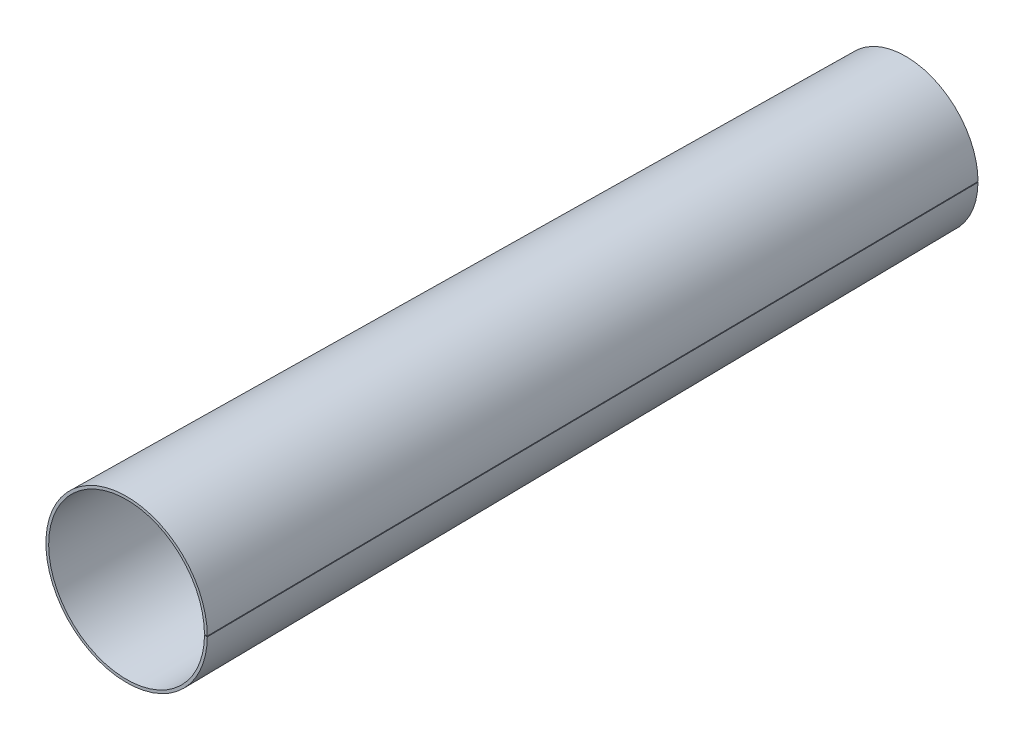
ISO-10303-21;
HEADER;
FILE_DESCRIPTION(('STEP AP214'),'2;1');
FILE_NAME('part.step','',(''),(''),'','','');
FILE_SCHEMA(('AUTOMOTIVE_DESIGN { 1 0 10303 214 1 1 1 1 }'));
ENDSEC;
DATA;
#1=APPLICATION_CONTEXT('core data for automotive mechanical design processes');
#2=APPLICATION_PROTOCOL_DEFINITION('international standard','automotive_design',2000,#1);
#3=PRODUCT_CONTEXT('',#1,'mechanical');
#4=PRODUCT('Part','Part','',(#3));
#5=PRODUCT_RELATED_PRODUCT_CATEGORY('part','',(#4));
#6=PRODUCT_DEFINITION_FORMATION('','',#4);
#7=PRODUCT_DEFINITION_CONTEXT('part definition',#1,'design');
#8=PRODUCT_DEFINITION('design','',#6,#7);
#9=PRODUCT_DEFINITION_SHAPE('','',#8);
#10=(LENGTH_UNIT() NAMED_UNIT(*) SI_UNIT(.MILLI.,.METRE.));
#11=(NAMED_UNIT(*) PLANE_ANGLE_UNIT() SI_UNIT($,.RADIAN.));
#12=(NAMED_UNIT(*) SI_UNIT($,.STERADIAN.) SOLID_ANGLE_UNIT());
#13=UNCERTAINTY_MEASURE_WITH_UNIT(LENGTH_MEASURE(1.E-05),#10,'distance_accuracy_value','');
#14=(GEOMETRIC_REPRESENTATION_CONTEXT(3) GLOBAL_UNCERTAINTY_ASSIGNED_CONTEXT((#13)) GLOBAL_UNIT_ASSIGNED_CONTEXT((#10,
#11,#12)) REPRESENTATION_CONTEXT('',''));
#15=CARTESIAN_POINT('',(0.,0.,0.));
#16=DIRECTION('',(0.,0.,1.));
#17=DIRECTION('',(1.,0.,0.));
#18=AXIS2_PLACEMENT_3D('',#15,#16,#17);
#19=CARTESIAN_POINT('',(27.9990169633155,-0.241377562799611,280.010713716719));
#20=CARTESIAN_POINT('',(27.9832421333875,-2.07120681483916,280.010713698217));
#21=CARTESIAN_POINT('',(27.7874830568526,-3.90006111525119,280.010713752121));
#22=CARTESIAN_POINT('',(27.0435907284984,-7.48334158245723,280.010713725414));
#23=CARTESIAN_POINT('',(26.4951962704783,-9.2390214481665,280.010713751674));
#24=CARTESIAN_POINT('',(25.0673832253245,-12.608755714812,280.010713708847));
#25=CARTESIAN_POINT('',(24.1874803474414,-14.2239538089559,280.010713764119));
#26=CARTESIAN_POINT('',(22.1305414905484,-17.2509240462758,280.010713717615));
#27=CARTESIAN_POINT('',(20.9527951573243,-18.6637412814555,280.010713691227));
#28=CARTESIAN_POINT('',(18.3455145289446,-21.2319794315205,280.01071369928));
#29=CARTESIAN_POINT('',(16.9150884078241,-22.3882788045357,280.010713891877));
#30=CARTESIAN_POINT('',(13.8574291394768,-24.399324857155,280.010713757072));
#31=CARTESIAN_POINT('',(12.2291425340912,-25.2547645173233,280.010713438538));
#32=CARTESIAN_POINT('',(8.83827120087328,-26.631556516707,280.010713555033));
#33=CARTESIAN_POINT('',(7.07452569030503,-27.1533801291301,280.010714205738));
#34=CARTESIAN_POINT('',(3.48040156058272,-27.8431646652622,280.010713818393));
#35=CARTESIAN_POINT('',(1.64878740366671,-28.0113627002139,280.010712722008));
#36=CARTESIAN_POINT('',(-2.01085677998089,-27.9877008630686,280.010713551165));
#37=CARTESIAN_POINT('',(-3.8401420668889,-27.7958328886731,280.010715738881));
#38=CARTESIAN_POINT('',(-7.42504666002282,-27.0596312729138,280.01071401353));
#39=CARTESIAN_POINT('',(-9.18189827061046,-26.5150445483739,280.010710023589));
#40=CARTESIAN_POINT('',(-12.5546822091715,-25.0945215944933,280.010711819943));
#41=CARTESIAN_POINT('',(-14.1717693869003,-24.2180990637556,280.010717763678));
#42=CARTESIAN_POINT('',(-17.2031712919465,-22.1676824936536,280.010717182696));
#43=CARTESIAN_POINT('',(-18.6185296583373,-20.9929823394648,280.010710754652));
#44=CARTESIAN_POINT('',(-21.1923780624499,-18.3912473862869,280.010710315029));
#45=CARTESIAN_POINT('',(-22.3517503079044,-16.9633210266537,280.010716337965));
#46=CARTESIAN_POINT('',(-24.3693852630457,-13.9100002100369,280.010716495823));
#47=CARTESIAN_POINT('',(-25.2283413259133,-12.283556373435,280.010710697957));
#48=CARTESIAN_POINT('',(-26.612446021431,-8.89565489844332,280.010710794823));
#49=CARTESIAN_POINT('',(-27.1380695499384,-7.13303492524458,280.010716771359));
#50=CARTESIAN_POINT('',(-27.8355985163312,-3.54040138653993,280.010716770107));
#51=CARTESIAN_POINT('',(-28.0077435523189,-1.70915377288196,280.010710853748));
#52=CARTESIAN_POINT('',(-27.9919688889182,1.95053408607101,280.010710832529));
#53=CARTESIAN_POINT('',(-27.8040437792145,3.78022965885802,280.010716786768));
#54=CARTESIAN_POINT('',(-27.0755700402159,7.36671657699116,280.010716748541));
#55=CARTESIAN_POINT('',(-26.5347711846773,9.12473985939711,280.010710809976));
#56=CARTESIAN_POINT('',(-25.1215121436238,12.5005836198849,280.01071067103));
#57=CARTESIAN_POINT('',(-24.2485670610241,14.1195622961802,280.010716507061));
#58=CARTESIAN_POINT('',(-22.2046855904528,17.1553764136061,280.010716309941));
#59=CARTESIAN_POINT('',(-21.0330468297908,18.5732552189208,280.010710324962));
#60=CARTESIAN_POINT('',(-18.4368655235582,21.1527053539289,280.010710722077));
#61=CARTESIAN_POINT('',(-17.0114331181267,22.3151606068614,280.010717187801));
#62=CARTESIAN_POINT('',(-13.9624680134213,24.3393684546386,280.01071772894));
#63=CARTESIAN_POINT('',(-12.3378856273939,25.2018181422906,280.010711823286));
#64=CARTESIAN_POINT('',(-8.9529812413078,26.5932128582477,280.010709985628));
#65=CARTESIAN_POINT('',(-7.19150024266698,27.1226342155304,280.010714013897));
#66=CARTESIAN_POINT('',(-3.60038235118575,27.827904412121,280.010715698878));
#67=CARTESIAN_POINT('',(-1.76951101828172,28.0039957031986,280.01071354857));
#68=CARTESIAN_POINT('',(1.89020115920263,27.9961082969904,280.01071267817));
#69=CARTESIAN_POINT('',(3.72029728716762,27.8121268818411,280.010713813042));
#70=CARTESIAN_POINT('',(7.30834150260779,27.0913844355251,280.010714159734));
#71=CARTESIAN_POINT('',(9.06752303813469,26.5543756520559,280.010713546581));
#72=CARTESIAN_POINT('',(12.4463995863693,25.1484034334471,280.01071338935));
#73=CARTESIAN_POINT('',(14.0672512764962,24.2789587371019,280.010713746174));
#74=CARTESIAN_POINT('',(17.1074604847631,22.2416285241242,280.010713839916));
#75=CARTESIAN_POINT('',(18.5278654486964,21.073040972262,280.010713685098));
#76=CARTESIAN_POINT('',(21.1129094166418,18.4824219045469,280.010713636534));
#77=CARTESIAN_POINT('',(22.2784326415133,17.059504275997,280.01071370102));
#78=CARTESIAN_POINT('',(24.3092007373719,14.0149144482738,280.010713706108));
#79=CARTESIAN_POINT('',(25.1751469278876,12.3921910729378,280.010713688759));
#80=CARTESIAN_POINT('',(26.5738577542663,9.01027340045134,280.010713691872));
#81=CARTESIAN_POINT('',(27.1070968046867,7.24993127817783,280.010713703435));
#82=CARTESIAN_POINT('',(27.8200714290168,3.66037115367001,280.010713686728));
#83=CARTESIAN_POINT('',(28.0000573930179,1.82989724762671,280.010713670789));
#84=CARTESIAN_POINT('',(28.0000573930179,0.,280.010713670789));
#85=CARTESIAN_POINT('',(28.9989224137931,-0.249997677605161,280.));
#86=CARTESIAN_POINT('',(28.9825825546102,-2.1453685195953,280.));
#87=CARTESIAN_POINT('',(28.7798804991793,-4.03910530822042,280.));
#88=CARTESIAN_POINT('',(28.0093276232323,-7.75080788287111,280.));
#89=CARTESIAN_POINT('',(27.4414768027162,-9.56877366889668,280.));
#90=CARTESIAN_POINT('',(25.9625083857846,-13.0592380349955,280.));
#91=CARTESIAN_POINT('',(25.0513907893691,-14.7317366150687,280.));
#92=CARTESIAN_POINT('',(22.9207450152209,-17.8671732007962,280.));
#93=CARTESIAN_POINT('',(21.7012168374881,-19.3301112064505,280.));
#94=CARTESIAN_POINT('',(19.0005175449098,-21.9903691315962,280.));
#95=CARTESIAN_POINT('',(17.5193464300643,-23.1876890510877,280.));
#96=CARTESIAN_POINT('',(14.352122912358,-25.2707963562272,280.));
#97=CARTESIAN_POINT('',(12.6660705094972,-26.1565837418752,280.));
#98=CARTESIAN_POINT('',(9.15370256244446,-27.5827068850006,280.));
#99=CARTESIAN_POINT('',(7.32738701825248,-28.123042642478,280.));
#100=CARTESIAN_POINT('',(3.60447915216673,-28.8375433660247,280.));
#101=CARTESIAN_POINT('',(1.70788683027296,-29.0117083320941,280.000000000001));
#102=CARTESIAN_POINT('',(-2.08288642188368,-28.987198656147,280.));
#103=CARTESIAN_POINT('',(-3.97706735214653,-28.7885240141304,279.999999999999));
#104=CARTESIAN_POINT('',(-7.69042526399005,-28.0259430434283,279.999999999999));
#105=CARTESIAN_POINT('',(-9.5096022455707,-27.4620367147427,280.));
#106=CARTESIAN_POINT('',(-13.0032349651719,-25.9906155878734,280.000000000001));
#107=CARTESIAN_POINT('',(-14.6776907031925,-25.0831007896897,280.));
#108=CARTESIAN_POINT('',(-17.8177152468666,-22.9592127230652,280.));
#109=CARTESIAN_POINT('',(-19.2832840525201,-21.7428394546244,280.));
#110=CARTESIAN_POINT('',(-21.9493549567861,-19.0478828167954,280.));
#111=CARTESIAN_POINT('',(-23.1498570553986,-17.5692994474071,280.));
#112=CARTESIAN_POINT('',(-25.2397874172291,-14.4065727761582,280.));
#113=CARTESIAN_POINT('',(-26.129215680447,-12.7224294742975,280.));
#114=CARTESIAN_POINT('',(-27.5629144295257,-9.21313561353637,280.));
#115=CARTESIAN_POINT('',(-28.1071849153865,-7.38798505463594,280.));
#116=CARTESIAN_POINT('',(-28.8297074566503,-3.6666217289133,280.));
#117=CARTESIAN_POINT('',(-29.0079595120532,-1.77040896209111,280.));
#118=CARTESIAN_POINT('',(-28.9916196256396,2.02040947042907,280.));
#119=CARTESIAN_POINT('',(-28.7970276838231,3.91501513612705,280.));
#120=CARTESIAN_POINT('',(-28.0424515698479,7.63001159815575,280.));
#121=CARTESIAN_POINT('',(-27.4824673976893,9.45040239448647,280.));
#122=CARTESIAN_POINT('',(-26.0185696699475,12.9472064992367,280.));
#123=CARTESIAN_POINT('',(-25.1146561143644,14.6236198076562,280.));
#124=CARTESIAN_POINT('',(-22.9975387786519,17.7682124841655,280.));
#125=CARTESIAN_POINT('',(-21.7843349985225,19.2363918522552,280.));
#126=CARTESIAN_POINT('',(-19.0951309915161,21.908265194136,280.));
#127=CARTESIAN_POINT('',(-17.6191307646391,23.111959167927,280.));
#128=CARTESIAN_POINT('',(-14.4609136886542,25.2086993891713,280.));
#129=CARTESIAN_POINT('',(-12.7786968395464,26.1017456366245,280.));
#130=CARTESIAN_POINT('',(-9.27250938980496,27.5429948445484,280.));
#131=CARTESIAN_POINT('',(-7.44853878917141,28.0911978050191,280.000000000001));
#132=CARTESIAN_POINT('',(-3.72874494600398,28.8217390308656,280.));
#133=CARTESIAN_POINT('',(-1.8329217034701,29.0040772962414,280.));
#134=CARTESIAN_POINT('',(1.95792197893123,28.9959072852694,279.999999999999));
#135=CARTESIAN_POINT('',(3.85294241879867,28.8053990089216,280.));
#136=CARTESIAN_POINT('',(7.56955251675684,28.0588310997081,280.000000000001));
#137=CARTESIAN_POINT('',(9.39114217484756,27.5027714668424,280.));
#138=CARTESIAN_POINT('',(12.8910855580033,26.0464225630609,280.));
#139=CARTESIAN_POINT('',(14.5694392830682,25.146133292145,280.));
#140=CARTESIAN_POINT('',(17.7185874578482,23.0357999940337,280.));
#141=CARTESIAN_POINT('',(19.1893819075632,21.8257559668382,280.));
#142=CARTESIAN_POINT('',(21.8670478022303,19.142315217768,280.));
#143=CARTESIAN_POINT('',(23.0739192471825,17.6689184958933,280.));
#144=CARTESIAN_POINT('',(25.1774564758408,14.5152309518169,280.));
#145=CARTESIAN_POINT('',(26.074122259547,12.8349401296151,280.));
#146=CARTESIAN_POINT('',(27.5229457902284,9.33185585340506,280.));
#147=CARTESIAN_POINT('',(28.0751035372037,7.50906239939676,280.));
#148=CARTESIAN_POINT('',(28.8136306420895,3.7908551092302,280.));
#149=CARTESIAN_POINT('',(29.,1.89544127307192,280.));
#150=CARTESIAN_POINT('',(29.,0.,280.));
#151=B_SPLINE_SURFACE_WITH_KNOTS('',1,3,((#19,#20,#21,#22,#23,#24,#25,#26,#27,#28,#29,#30,#31,
#32,#33,#34,#35,#36,#37,#38,#39,#40,#41,#42,#43,#44,#45,#46,#47,#48,#49,#50,#51,#52,#53,#54,#55,
#56,#57,#58,#59,#60,#61,#62,#63,#64,#65,#66,#67,#68,#69,#70,#71,#72,#73,#74,#75,#76,#77,#78,#79,
#80,#81,#82,#83,#84),(#85,#86,#87,#88,#89,#90,#91,#92,#93,#94,#95,#96,#97,#98,#99,#100,#101,
#102,#103,#104,#105,#106,#107,#108,#109,#110,#111,#112,#113,#114,#115,#116,#117,#118,#119,#120,
#121,#122,#123,#124,#125,#126,#127,#128,#129,#130,#131,#132,#133,#134,#135,#136,#137,#138,#139,
#140,#141,#142,#143,#144,#145,#146,#147,#148,#149,#150)),.UNSPECIFIED.,.F.,.F.,.F.,(2,2),(4,2,2,
2,2,2,2,2,2,2,2,2,2,2,2,2,2,2,2,2,2,2,2,2,2,2,2,2,2,2,2,2,4),(0.,1.),(0.,0.03125,0.0625,0.09375,
0.125,0.15625,0.1875,0.21875,0.25,0.28125,0.3125,0.34375,0.375,0.40625,0.4375,0.46875,0.5,
0.53125,0.5625,0.59375,0.625,0.65625,0.6875,0.71875,0.75,0.78125,0.8125,0.84375,0.875,0.90625,
0.9375,0.96875,1.),.UNSPECIFIED.);
#152=CARTESIAN_POINT('',(28.0000573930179,0.,280.010713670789));
#153=CARTESIAN_POINT('',(29.,0.,280.));
#154=B_SPLINE_CURVE_WITH_KNOTS('',1,(#152,#153),.UNSPECIFIED.,.F.,.F.,(2,2),(0.,1.),.UNSPECIFIED.);
#155=CARTESIAN_POINT('',(29.,0.,280.));
#156=VERTEX_POINT('',#155);
#157=CARTESIAN_POINT('',(28.0000573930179,0.,280.010713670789));
#158=VERTEX_POINT('',#157);
#159=EDGE_CURVE('E14',#156,#158,#154,.F.);
#160=CARTESIAN_POINT('',(29.,0.,280.));
#161=CARTESIAN_POINT('',(29.,1.89544127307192,280.));
#162=CARTESIAN_POINT('',(28.8136306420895,3.7908551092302,280.));
#163=CARTESIAN_POINT('',(28.0751035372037,7.50906239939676,280.));
#164=CARTESIAN_POINT('',(27.5229457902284,9.33185585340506,280.));
#165=CARTESIAN_POINT('',(26.074122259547,12.8349401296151,280.));
#166=CARTESIAN_POINT('',(25.1774564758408,14.5152309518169,280.));
#167=CARTESIAN_POINT('',(23.0739192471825,17.6689184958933,280.));
#168=CARTESIAN_POINT('',(21.8670478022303,19.142315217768,280.));
#169=CARTESIAN_POINT('',(19.1893819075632,21.8257559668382,280.));
#170=CARTESIAN_POINT('',(17.7185874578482,23.0357999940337,280.));
#171=CARTESIAN_POINT('',(14.5694392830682,25.146133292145,280.));
#172=CARTESIAN_POINT('',(12.8910855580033,26.0464225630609,280.));
#173=CARTESIAN_POINT('',(9.39114217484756,27.5027714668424,280.));
#174=CARTESIAN_POINT('',(7.56955251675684,28.0588310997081,280.000000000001));
#175=CARTESIAN_POINT('',(3.85294241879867,28.8053990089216,280.));
#176=CARTESIAN_POINT('',(1.95792197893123,28.9959072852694,279.999999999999));
#177=CARTESIAN_POINT('',(-1.8329217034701,29.0040772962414,280.));
#178=CARTESIAN_POINT('',(-3.72874494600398,28.8217390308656,280.));
#179=CARTESIAN_POINT('',(-7.44853878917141,28.0911978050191,280.000000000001));
#180=CARTESIAN_POINT('',(-9.27250938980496,27.5429948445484,280.));
#181=CARTESIAN_POINT('',(-12.7786968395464,26.1017456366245,280.));
#182=CARTESIAN_POINT('',(-14.4609136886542,25.2086993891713,280.));
#183=CARTESIAN_POINT('',(-17.6191307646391,23.111959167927,280.));
#184=CARTESIAN_POINT('',(-19.0951309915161,21.908265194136,280.));
#185=CARTESIAN_POINT('',(-21.7843349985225,19.2363918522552,280.));
#186=CARTESIAN_POINT('',(-22.9975387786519,17.7682124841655,280.));
#187=CARTESIAN_POINT('',(-25.1146561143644,14.6236198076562,280.));
#188=CARTESIAN_POINT('',(-26.0185696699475,12.9472064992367,280.));
#189=CARTESIAN_POINT('',(-27.4824673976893,9.45040239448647,280.));
#190=CARTESIAN_POINT('',(-28.0424515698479,7.63001159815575,280.));
#191=CARTESIAN_POINT('',(-28.7970276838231,3.91501513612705,280.));
#192=CARTESIAN_POINT('',(-28.9916196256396,2.02040947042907,280.));
#193=CARTESIAN_POINT('',(-29.0079595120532,-1.77040896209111,280.));
#194=CARTESIAN_POINT('',(-28.8297074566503,-3.6666217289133,280.));
#195=CARTESIAN_POINT('',(-28.1071849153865,-7.38798505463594,280.));
#196=CARTESIAN_POINT('',(-27.5629144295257,-9.21313561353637,280.));
#197=CARTESIAN_POINT('',(-26.129215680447,-12.7224294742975,280.));
#198=CARTESIAN_POINT('',(-25.2397874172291,-14.4065727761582,280.));
#199=CARTESIAN_POINT('',(-23.1498570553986,-17.5692994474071,280.));
#200=CARTESIAN_POINT('',(-21.9493549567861,-19.0478828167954,280.));
#201=CARTESIAN_POINT('',(-19.2832840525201,-21.7428394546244,280.));
#202=CARTESIAN_POINT('',(-17.8177152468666,-22.9592127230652,280.));
#203=CARTESIAN_POINT('',(-14.6776907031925,-25.0831007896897,280.));
#204=CARTESIAN_POINT('',(-13.0032349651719,-25.9906155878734,280.000000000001));
#205=CARTESIAN_POINT('',(-9.5096022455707,-27.4620367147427,280.));
#206=CARTESIAN_POINT('',(-7.69042526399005,-28.0259430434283,279.999999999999));
#207=CARTESIAN_POINT('',(-3.97706735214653,-28.7885240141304,279.999999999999));
#208=CARTESIAN_POINT('',(-2.08288642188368,-28.987198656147,280.));
#209=CARTESIAN_POINT('',(1.70788683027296,-29.0117083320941,280.000000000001));
#210=CARTESIAN_POINT('',(3.60447915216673,-28.8375433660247,280.));
#211=CARTESIAN_POINT('',(7.32738701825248,-28.123042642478,280.));
#212=CARTESIAN_POINT('',(9.15370256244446,-27.5827068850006,280.));
#213=CARTESIAN_POINT('',(12.6660705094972,-26.1565837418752,280.));
#214=CARTESIAN_POINT('',(14.352122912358,-25.2707963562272,280.));
#215=CARTESIAN_POINT('',(17.5193464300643,-23.1876890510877,280.));
#216=CARTESIAN_POINT('',(19.0005175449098,-21.9903691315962,280.));
#217=CARTESIAN_POINT('',(21.7012168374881,-19.3301112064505,280.));
#218=CARTESIAN_POINT('',(22.9207450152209,-17.8671732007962,280.));
#219=CARTESIAN_POINT('',(25.0513907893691,-14.7317366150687,280.));
#220=CARTESIAN_POINT('',(25.9625083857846,-13.0592380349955,280.));
#221=CARTESIAN_POINT('',(27.4414768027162,-9.56877366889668,280.));
#222=CARTESIAN_POINT('',(28.0093276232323,-7.75080788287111,280.));
#223=CARTESIAN_POINT('',(28.7798804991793,-4.03910530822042,280.));
#224=CARTESIAN_POINT('',(28.9825825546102,-2.1453685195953,280.));
#225=CARTESIAN_POINT('',(28.9989224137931,-0.249997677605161,280.));
#226=B_SPLINE_CURVE_WITH_KNOTS('',3,(#160,#161,#162,#163,#164,#165,#166,#167,#168,#169,#170,
#171,#172,#173,#174,#175,#176,#177,#178,#179,#180,#181,#182,#183,#184,#185,#186,#187,#188,#189,
#190,#191,#192,#193,#194,#195,#196,#197,#198,#199,#200,#201,#202,#203,#204,#205,#206,#207,#208,
#209,#210,#211,#212,#213,#214,#215,#216,#217,#218,#219,#220,#221,#222,#223,#224,#225),
.UNSPECIFIED.,.F.,.F.,(4,2,2,2,2,2,2,2,2,2,2,2,2,2,2,2,2,2,2,2,2,2,2,2,2,2,2,2,2,2,2,2,4),(0.,
0.03125,0.0625,0.09375,0.125,0.15625,0.1875,0.21875,0.25,0.28125,0.3125,0.34375,0.375,0.40625,
0.4375,0.46875,0.5,0.53125,0.5625,0.59375,0.625,0.65625,0.6875,0.71875,0.75,0.78125,0.8125,
0.84375,0.875,0.90625,0.9375,0.96875,1.),.UNSPECIFIED.);
#227=CARTESIAN_POINT('',(28.9989224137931,-0.249997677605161,280.));
#228=VERTEX_POINT('',#227);
#229=EDGE_CURVE('E239',#156,#228,#226,.T.);
#230=CARTESIAN_POINT('',(28.9989224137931,-0.249997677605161,280.));
#231=CARTESIAN_POINT('',(27.9990169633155,-0.241377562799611,280.010713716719));
#232=B_SPLINE_CURVE_WITH_KNOTS('',1,(#230,#231),.UNSPECIFIED.,.F.,.F.,(2,2),(0.,1.),.UNSPECIFIED.);
#233=CARTESIAN_POINT('',(27.9990169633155,-0.241377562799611,280.010713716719));
#234=VERTEX_POINT('',#233);
#235=EDGE_CURVE('E73',#228,#234,#232,.T.);
#236=CARTESIAN_POINT('',(28.0000573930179,0.,280.01071367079));
#237=CARTESIAN_POINT('',(28.000056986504,0.45750654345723,280.010713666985));
#238=CARTESIAN_POINT('',(27.9888104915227,0.915009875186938,280.010713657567));
#239=CARTESIAN_POINT('',(27.9439295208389,1.82895581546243,280.01071364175));
#240=CARTESIAN_POINT('',(27.9102931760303,2.28539833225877,280.010713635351));
#241=CARTESIAN_POINT('',(27.8207370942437,3.19608795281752,280.010713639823));
#242=CARTESIAN_POINT('',(27.7648175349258,3.65033507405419,280.010713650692));
#243=CARTESIAN_POINT('',(27.6308041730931,4.55550238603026,280.010713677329));
#244=CARTESIAN_POINT('',(27.5527125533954,5.00642289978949,280.010713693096));
#245=CARTESIAN_POINT('',(27.3744553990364,5.90388094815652,280.010713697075));
#246=CARTESIAN_POINT('',(27.2742897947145,6.35041846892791,280.010713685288));
#247=CARTESIAN_POINT('',(27.0521994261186,7.23809565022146,280.010713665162));
#248=CARTESIAN_POINT('',(26.9302724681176,7.67923476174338,280.010713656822));
#249=CARTESIAN_POINT('',(26.6649866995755,8.5550233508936,280.010713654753));
#250=CARTESIAN_POINT('',(26.5216277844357,8.98967279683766,280.010713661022));
#251=CARTESIAN_POINT('',(26.2138104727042,9.85139154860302,280.010713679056));
#252=CARTESIAN_POINT('',(26.0493540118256,10.2784615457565,280.01071369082));
#253=CARTESIAN_POINT('',(25.6996509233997,11.124002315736,280.010713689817));
#254=CARTESIAN_POINT('',(25.5144043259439,11.5424731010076,280.01071367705));
#255=CARTESIAN_POINT('',(25.1236256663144,12.3698785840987,280.010713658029));
#256=CARTESIAN_POINT('',(24.91809175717,12.7788124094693,280.010713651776));
#257=CARTESIAN_POINT('',(24.4872695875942,13.5861372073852,280.010713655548));
#258=CARTESIAN_POINT('',(24.2619813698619,13.9845282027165,280.010713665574));
#259=CARTESIAN_POINT('',(23.792186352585,14.7697628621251,280.010713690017));
#260=CARTESIAN_POINT('',(23.5476813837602,15.1566076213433,280.010713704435));
#261=CARTESIAN_POINT('',(23.0399516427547,15.917811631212,280.010713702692));
#262=CARTESIAN_POINT('',(22.77672684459,16.2921708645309,280.010713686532));
#263=CARTESIAN_POINT('',(22.2322355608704,17.0275848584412,280.010713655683));
#264=CARTESIAN_POINT('',(21.9509673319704,17.3886383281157,280.010713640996));
#265=CARTESIAN_POINT('',(21.3711075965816,18.0965569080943,280.010713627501));
#266=CARTESIAN_POINT('',(21.0725160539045,18.4434219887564,280.010713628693));
#267=CARTESIAN_POINT('',(20.4587322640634,19.122083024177,280.010713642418));
#268=CARTESIAN_POINT('',(20.143541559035,19.4538803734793,280.010713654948));
#269=CARTESIAN_POINT('',(19.49723321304,20.1015825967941,280.010713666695));
#270=CARTESIAN_POINT('',(19.166115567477,20.41748746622,280.010713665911));
#271=CARTESIAN_POINT('',(18.4887781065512,21.032732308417,280.010713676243));
#272=CARTESIAN_POINT('',(18.1425568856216,21.3320707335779,280.01071368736));
#273=CARTESIAN_POINT('',(17.4358886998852,21.9134550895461,280.010713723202));
#274=CARTESIAN_POINT('',(17.0754417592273,22.1955010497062,280.010713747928));
#275=CARTESIAN_POINT('',(16.3412020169,22.741576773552,280.010713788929));
#276=CARTESIAN_POINT('',(15.9674105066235,23.0056082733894,280.010713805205));
#277=CARTESIAN_POINT('',(15.2073019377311,23.5149785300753,280.010713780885));
#278=CARTESIAN_POINT('',(14.8209849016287,23.7603173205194,280.010713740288));
#279=CARTESIAN_POINT('',(14.0367648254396,24.2318044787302,280.010713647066));
#280=CARTESIAN_POINT('',(13.6388607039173,24.4579510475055,280.010713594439));
#281=CARTESIAN_POINT('',(12.8324677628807,24.8905117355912,280.01071350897));
#282=CARTESIAN_POINT('',(12.4239789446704,25.0969258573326,280.010713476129));
#283=CARTESIAN_POINT('',(11.5974205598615,25.489484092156,280.010713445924));
#284=CARTESIAN_POINT('',(11.1793518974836,25.6756301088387,280.010713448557));
#285=CARTESIAN_POINT('',(10.3345706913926,26.0271489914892,280.010713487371));
#286=CARTESIAN_POINT('',(9.90785814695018,26.192521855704,280.010713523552));
#287=CARTESIAN_POINT('',(9.04680801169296,26.5021885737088,280.010713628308));
#288=CARTESIAN_POINT('',(8.61246970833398,26.6464804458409,280.010713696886));
#289=CARTESIAN_POINT('',(7.73725577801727,26.9136480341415,280.010713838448));
#290=CARTESIAN_POINT('',(7.29638015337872,27.0365237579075,280.010713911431));
#291=CARTESIAN_POINT('',(6.40918101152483,27.2605268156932,280.010714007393));
#292=CARTESIAN_POINT('',(5.96285801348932,27.3616562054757,280.010714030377));
#293=CARTESIAN_POINT('',(5.06578074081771,27.5418551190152,280.0107139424));
#294=CARTESIAN_POINT('',(4.61502646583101,27.6209246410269,280.010713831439));
#295=CARTESIAN_POINT('',(3.71014534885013,27.7569026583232,280.010713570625));
#296=CARTESIAN_POINT('',(3.25601819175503,27.8138090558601,280.010713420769));
#297=CARTESIAN_POINT('',(2.34552397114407,27.9053423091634,280.010713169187));
#298=CARTESIAN_POINT('',(1.88915690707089,27.9399691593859,280.01071306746));
#299=CARTESIAN_POINT('',(0.975316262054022,27.9868299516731,280.010712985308));
#300=CARTESIAN_POINT('',(0.517842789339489,27.9990660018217,280.010713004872));
#301=CARTESIAN_POINT('',(-0.397152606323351,28.0010379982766,280.010713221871));
#302=CARTESIAN_POINT('',(-0.854674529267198,27.9907739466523,280.010713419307));
#303=CARTESIAN_POINT('',(-1.76870854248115,27.9478525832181,280.010713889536));
#304=CARTESIAN_POINT('',(-2.22522053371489,27.9151931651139,280.010714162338));
#305=CARTESIAN_POINT('',(-3.13610067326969,27.8275853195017,280.010714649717));
#306=CARTESIAN_POINT('',(-3.59046882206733,27.772636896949,280.010714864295));
#307=CARTESIAN_POINT('',(-4.49592756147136,27.6405604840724,280.010715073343));
#308=CARTESIAN_POINT('',(-4.94701845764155,27.5634345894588,280.010715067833));
#309=CARTESIAN_POINT('',(-5.8448641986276,27.3871040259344,280.010714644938));
#310=CARTESIAN_POINT('',(-6.29161904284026,27.2878993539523,280.010714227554));
#311=CARTESIAN_POINT('',(-7.17977569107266,27.0677224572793,280.01071324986));
#312=CARTESIAN_POINT('',(-7.62117698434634,26.9467481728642,280.010712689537));
#313=CARTESIAN_POINT('',(-8.49753458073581,26.6833554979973,280.010711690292));
#314=CARTESIAN_POINT('',(-8.93249088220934,26.5409371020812,280.010711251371));
#315=CARTESIAN_POINT('',(-9.79486783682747,26.2349846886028,280.010710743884));
#316=CARTESIAN_POINT('',(-10.2222891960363,26.0714526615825,280.010710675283));
#317=CARTESIAN_POINT('',(-11.0685774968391,25.7235784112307,280.010711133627));
#318=CARTESIAN_POINT('',(-11.4874444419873,25.5392361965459,280.010711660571));
#319=CARTESIAN_POINT('',(-12.3156868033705,25.1502444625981,280.010712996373));
#320=CARTESIAN_POINT('',(-12.7250613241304,24.9455930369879,280.010713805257));
#321=CARTESIAN_POINT('',(-13.5333109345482,24.5165122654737,280.010715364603));
#322=CARTESIAN_POINT('',(-13.9321860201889,24.2920829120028,280.010716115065));
#323=CARTESIAN_POINT('',(-14.7184311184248,23.8239803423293,280.010717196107));
#324=CARTESIAN_POINT('',(-15.1058021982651,23.5803089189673,280.010717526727));
#325=CARTESIAN_POINT('',(-15.8680998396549,23.0742195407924,280.01071739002));
#326=CARTESIAN_POINT('',(-16.2430263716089,22.8118015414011,280.01071692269));
#327=CARTESIAN_POINT('',(-16.9796139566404,22.2688954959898,280.01071560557));
#328=CARTESIAN_POINT('',(-17.3412737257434,21.9884057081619,280.010714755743));
#329=CARTESIAN_POINT('',(-18.0504419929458,21.410072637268,280.01071307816));
#330=CARTESIAN_POINT('',(-18.3979504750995,21.1122293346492,280.010712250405));
#331=CARTESIAN_POINT('',(-19.0779334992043,20.4999099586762,280.010710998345));
#332=CARTESIAN_POINT('',(-19.4104094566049,20.1854354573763,280.010710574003));
#333=CARTESIAN_POINT('',(-20.059502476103,19.5405255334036,280.010710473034));
#334=CARTESIAN_POINT('',(-20.3761195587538,19.2100901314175,280.010710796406));
#335=CARTESIAN_POINT('',(-20.9928211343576,18.5340814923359,280.010711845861));
#336=CARTESIAN_POINT('',(-21.2929040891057,18.1885068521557,280.010712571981));
#337=CARTESIAN_POINT('',(-21.8758084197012,17.4830943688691,280.010714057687));
#338=CARTESIAN_POINT('',(-22.158629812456,17.1232565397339,280.010714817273));
#339=CARTESIAN_POINT('',(-22.7062859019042,16.3901957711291,280.010715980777));
#340=CARTESIAN_POINT('',(-22.9711223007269,16.016974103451,280.010716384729));
#341=CARTESIAN_POINT('',(-23.4821303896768,15.2579645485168,280.010716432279));
#342=CARTESIAN_POINT('',(-23.7283020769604,14.8721766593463,280.010716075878));
#343=CARTESIAN_POINT('',(-24.2014805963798,14.0889733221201,280.01071499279));
#344=CARTESIAN_POINT('',(-24.4284856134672,13.6915567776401,280.010714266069));
#345=CARTESIAN_POINT('',(-24.8627861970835,12.8860964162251,280.010712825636));
#346=CARTESIAN_POINT('',(-25.07008176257,12.4780525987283,280.010712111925));
#347=CARTESIAN_POINT('',(-25.4644233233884,11.6523406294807,280.010711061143));
#348=CARTESIAN_POINT('',(-25.6514712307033,11.2346733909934,280.010710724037));
#349=CARTESIAN_POINT('',(-26.0048120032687,10.3906503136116,280.010710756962));
#350=CARTESIAN_POINT('',(-26.1711048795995,9.96429447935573,280.010711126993));
#351=CARTESIAN_POINT('',(-26.4826277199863,9.10391232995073,280.010712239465));
#352=CARTESIAN_POINT('',(-26.6278557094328,8.66988529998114,280.010712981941));
#353=CARTESIAN_POINT('',(-26.8969094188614,7.79524780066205,280.010714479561));
#354=CARTESIAN_POINT('',(-27.0207351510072,7.35463733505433,280.010715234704));
#355=CARTESIAN_POINT('',(-27.2466498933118,6.46792172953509,280.010716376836));
#356=CARTESIAN_POINT('',(-27.3487409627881,6.0218171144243,280.01071676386));
#357=CARTESIAN_POINT('',(-27.5308728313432,5.12512924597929,280.010716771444));
#358=CARTESIAN_POINT('',(-27.6109136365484,4.67454599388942,280.010716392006));
#359=CARTESIAN_POINT('',(-27.7488415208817,3.7699593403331,280.010715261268));
#360=CARTESIAN_POINT('',(-27.806726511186,3.31595562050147,280.010714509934));
#361=CARTESIAN_POINT('',(-27.9002218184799,2.40566036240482,280.010713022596));
#362=CARTESIAN_POINT('',(-27.9358321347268,1.94936882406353,280.010712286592));
#363=CARTESIAN_POINT('',(-27.9846622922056,1.0356309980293,280.010711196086));
#364=CARTESIAN_POINT('',(-27.9978842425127,0.57818482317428,280.010710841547));
#365=CARTESIAN_POINT('',(-28.0018281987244,-0.336804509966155,280.010710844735));
#366=CARTESIAN_POINT('',(-27.9925502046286,-0.794347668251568,280.010711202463));
#367=CARTESIAN_POINT('',(-27.9515988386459,-1.70847248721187,280.010712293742));
#368=CARTESIAN_POINT('',(-27.9199233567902,-2.16505405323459,280.01071302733));
#369=CARTESIAN_POINT('',(-27.8342788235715,-3.07612147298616,280.010714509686));
#370=CARTESIAN_POINT('',(-27.7803097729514,-3.53060732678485,280.010715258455));
#371=CARTESIAN_POINT('',(-27.6501851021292,-4.43634939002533,280.010716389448));
#372=CARTESIAN_POINT('',(-27.5740315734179,-4.88760589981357,280.010716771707));
#373=CARTESIAN_POINT('',(-27.3996364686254,-5.78583053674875,280.010716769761));
#374=CARTESIAN_POINT('',(-27.301394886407,-6.23279866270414,280.010716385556));
#375=CARTESIAN_POINT('',(-27.0831325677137,-7.1214288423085,280.010715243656));
#376=CARTESIAN_POINT('',(-26.9631097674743,-7.56309038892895,280.010714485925));
#377=CARTESIAN_POINT('',(-26.7016059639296,-8.44001479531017,280.01071298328));
#378=CARTESIAN_POINT('',(-26.5601249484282,-8.87527765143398,280.010712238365));
#379=CARTESIAN_POINT('',(-26.2560307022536,-9.73831334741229,280.010711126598));
#380=CARTESIAN_POINT('',(-26.0934194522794,-10.1660868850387,280.01071075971));
#381=CARTESIAN_POINT('',(-25.7473678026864,-11.0131246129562,280.010710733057));
#382=CARTESIAN_POINT('',(-25.5639273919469,-11.4323887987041,280.010711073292));
#383=CARTESIAN_POINT('',(-25.1767186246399,-12.2614695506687,280.010712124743));
#384=CARTESIAN_POINT('',(-24.9729483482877,-12.6712852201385,280.010712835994));
#385=CARTESIAN_POINT('',(-24.5456074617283,-13.4804595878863,280.010714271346));
#386=CARTESIAN_POINT('',(-24.322036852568,-13.879818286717,280.010714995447));
#387=CARTESIAN_POINT('',(-23.8556276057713,-14.6670716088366,280.0107160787));
#388=CARTESIAN_POINT('',(-23.612790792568,-15.0549673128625,280.010716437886));
#389=CARTESIAN_POINT('',(-23.1083448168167,-15.8183538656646,280.010716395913));
#390=CARTESIAN_POINT('',(-22.8467356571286,-16.1938447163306,280.010715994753));
#391=CARTESIAN_POINT('',(-22.3054193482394,-16.9315993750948,280.010714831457));
#392=CARTESIAN_POINT('',(-22.0257104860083,-17.2938619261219,280.010714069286));
#393=CARTESIAN_POINT('',(-21.4489089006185,-18.0042731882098,280.010712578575));
#394=CARTESIAN_POINT('',(-21.1518161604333,-18.3524218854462,280.010711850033));
#395=CARTESIAN_POINT('',(-20.5409651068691,-19.0337217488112,280.010710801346));
#396=CARTESIAN_POINT('',(-20.2272083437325,-19.3668743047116,280.010710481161));
#397=CARTESIAN_POINT('',(-19.5836989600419,-20.0173558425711,280.01071058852));
#398=CARTESIAN_POINT('',(-19.2539463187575,-20.3346848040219,280.010711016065));
#399=CARTESIAN_POINT('',(-18.5792671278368,-20.9528432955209,280.010712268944));
#400=CARTESIAN_POINT('',(-18.2343391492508,-21.2536712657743,280.010713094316));
#401=CARTESIAN_POINT('',(-17.5301828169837,-21.8380963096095,280.010714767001));
#402=CARTESIAN_POINT('',(-17.1709544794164,-22.1216934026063,280.010715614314));
#403=CARTESIAN_POINT('',(-16.4390744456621,-22.6709291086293,280.01071693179));
#404=CARTESIAN_POINT('',(-16.0664240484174,-22.9365694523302,280.010717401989));
#405=CARTESIAN_POINT('',(-15.3085175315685,-23.4492114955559,280.010717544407));
#406=CARTESIAN_POINT('',(-14.9232614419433,-23.6962132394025,280.010717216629));
#407=CARTESIAN_POINT('',(-14.1410808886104,-24.1710763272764,280.010716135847));
#408=CARTESIAN_POINT('',(-13.7441553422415,-24.3989358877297,280.010715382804));
#409=CARTESIAN_POINT('',(-12.9396347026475,-24.8349683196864,280.010713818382));
#410=CARTESIAN_POINT('',(-12.5320396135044,-25.0431411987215,280.010713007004));
#411=CARTESIAN_POINT('',(-11.7071813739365,-25.4392584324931,280.010711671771));
#412=CARTESIAN_POINT('',(-11.2899191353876,-25.627204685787,280.01071114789));
#413=CARTESIAN_POINT('',(-10.4466611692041,-25.9823615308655,280.010710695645));
#414=CARTESIAN_POINT('',(-10.0206654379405,-26.1495721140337,280.010710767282));
#415=CARTESIAN_POINT('',(-9.16095802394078,-26.4629473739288,280.010711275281));
#416=CARTESIAN_POINT('',(-8.72724561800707,-26.6091100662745,280.010711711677));
#417=CARTESIAN_POINT('',(-7.853191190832,-26.8800476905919,280.010712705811));
#418=CARTESIAN_POINT('',(-7.41284917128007,-27.0048226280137,280.010713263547));
#419=CARTESIAN_POINT('',(-6.52662358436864,-27.2326477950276,280.010714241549));
#420=CARTESIAN_POINT('',(-6.08074054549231,-27.3357000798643,280.010714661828));
#421=CARTESIAN_POINT('',(-5.1844482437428,-27.5197640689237,280.010715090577));
#422=CARTESIAN_POINT('',(-4.7340389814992,-27.6007757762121,280.010715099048));
#423=CARTESIAN_POINT('',(-3.82975246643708,-27.7406528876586,280.010714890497));
#424=CARTESIAN_POINT('',(-3.37587488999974,-27.7995161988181,280.010714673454));
#425=CARTESIAN_POINT('',(-2.46578383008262,-27.894973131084,280.010714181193));
#426=CARTESIAN_POINT('',(-2.00957034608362,-27.9315667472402,280.010713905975));
#427=CARTESIAN_POINT('',(-1.09594030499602,-27.9823660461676,280.010713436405));
#428=CARTESIAN_POINT('',(-0.638523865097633,-27.9965738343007,280.010713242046));
#429=CARTESIAN_POINT('',(0.27645453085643,-28.0024897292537,280.010713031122));
#430=CARTESIAN_POINT('',(0.734016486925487,-27.9941978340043,280.010713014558));
#431=CARTESIAN_POINT('',(1.64822714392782,-27.9552166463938,280.010713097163));
#432=CARTESIAN_POINT('',(2.10487575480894,-27.9245252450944,280.010713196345));
#433=CARTESIAN_POINT('',(3.01612521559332,-27.8408444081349,280.010713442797));
#434=CARTESIAN_POINT('',(3.47072606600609,-27.7878549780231,280.010713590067));
#435=CARTESIAN_POINT('',(4.37674577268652,-27.6596826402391,280.010713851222));
#436=CARTESIAN_POINT('',(4.82816492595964,-27.5845018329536,280.01071396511));
#437=CARTESIAN_POINT('',(5.72676228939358,-27.4120429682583,280.010714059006));
#438=CARTESIAN_POINT('',(6.17394049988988,-27.3147649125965,280.010714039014));
#439=CARTESIAN_POINT('',(7.06303771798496,-27.0984183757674,280.010713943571));
#440=CARTESIAN_POINT('',(7.50495622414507,-26.9793478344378,280.010713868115));
#441=CARTESIAN_POINT('',(8.38244078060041,-26.7197350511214,280.010713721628));
#442=CARTESIAN_POINT('',(8.81800682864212,-26.5791928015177,280.010713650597));
#443=CARTESIAN_POINT('',(9.68169448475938,-26.2769603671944,280.010713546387));
#444=CARTESIAN_POINT('',(10.1098167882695,-26.1152721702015,280.010713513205));
#445=CARTESIAN_POINT('',(10.9575969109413,-25.7710488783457,280.01071348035));
#446=CARTESIAN_POINT('',(11.3772547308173,-25.5885137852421,280.010713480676));
#447=CARTESIAN_POINT('',(12.207166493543,-25.203095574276,280.010713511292));
#448=CARTESIAN_POINT('',(12.6174195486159,-25.0002105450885,280.010713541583));
#449=CARTESIAN_POINT('',(13.4275114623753,-24.5746175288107,280.010713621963));
#450=CARTESIAN_POINT('',(13.827350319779,-24.3519095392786,280.010713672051));
#451=CARTESIAN_POINT('',(14.6156057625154,-23.8872003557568,280.010713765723));
#452=CARTESIAN_POINT('',(15.0040234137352,-23.6452009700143,280.010713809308));
#453=CARTESIAN_POINT('',(15.7684948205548,-23.1424022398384,280.010713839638));
#454=CARTESIAN_POINT('',(16.1445485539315,-22.8816028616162,280.010713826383));
#455=CARTESIAN_POINT('',(16.8834685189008,-22.3418770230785,280.010713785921));
#456=CARTESIAN_POINT('',(17.2463334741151,-22.0629488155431,280.010713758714));
#457=CARTESIAN_POINT('',(17.9579872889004,-21.4876779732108,280.010713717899));
#458=CARTESIAN_POINT('',(18.3067761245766,-21.1913353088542,280.010713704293));
#459=CARTESIAN_POINT('',(18.9893922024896,-20.5819523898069,280.01071369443));
#460=CARTESIAN_POINT('',(19.3232208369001,-20.268913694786,280.010713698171));
#461=CARTESIAN_POINT('',(19.9750887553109,-19.6268071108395,280.010713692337));
#462=CARTESIAN_POINT('',(20.293128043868,-19.2977392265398,280.010713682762));
#463=CARTESIAN_POINT('',(20.9127394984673,-18.624394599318,280.010713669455));
#464=CARTESIAN_POINT('',(21.2143101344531,-18.2801164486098,280.010713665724));
#465=CARTESIAN_POINT('',(21.8002510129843,-17.5772229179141,280.010713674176));
#466=CARTESIAN_POINT('',(22.0846212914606,-17.2186075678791,280.010713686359));
#467=CARTESIAN_POINT('',(22.6354320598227,-16.487914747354,280.010713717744));
#468=CARTESIAN_POINT('',(22.9018742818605,-16.1158385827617,280.010713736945));
#469=CARTESIAN_POINT('',(23.4161471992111,-15.3590397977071,280.010713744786));
#470=CARTESIAN_POINT('',(23.6639779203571,-14.9743171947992,280.010713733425));
#471=CARTESIAN_POINT('',(24.1405246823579,-14.193161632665,280.01071370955));
#472=CARTESIAN_POINT('',(24.3692389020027,-13.796727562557,280.010713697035));
#473=CARTESIAN_POINT('',(24.8070046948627,-12.9931467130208,280.010713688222));
#474=CARTESIAN_POINT('',(25.0160562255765,-12.5859999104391,280.010713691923));
#475=CARTESIAN_POINT('',(25.4139531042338,-11.7619939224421,280.010713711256));
#476=CARTESIAN_POINT('',(25.6028002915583,-11.3451356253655,280.010713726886));
#477=CARTESIAN_POINT('',(25.9597794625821,-10.5026409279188,280.010713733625));
#478=CARTESIAN_POINT('',(26.1279114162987,-10.0770045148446,280.010713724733));
#479=CARTESIAN_POINT('',(26.4431458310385,-9.21797135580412,280.010713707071));
#480=CARTESIAN_POINT('',(26.5902463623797,-8.78457390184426,280.0107136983));
#481=CARTESIAN_POINT('',(26.8630721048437,-7.91110478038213,280.010713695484));
#482=CARTESIAN_POINT('',(26.9887974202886,-7.47103314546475,280.010713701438));
#483=CARTESIAN_POINT('',(27.2185318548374,-6.58530350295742,280.010713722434));
#484=CARTESIAN_POINT('',(27.3225431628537,-6.13964606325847,280.010713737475));
#485=CARTESIAN_POINT('',(27.508530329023,-5.24375804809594,280.010713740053));
#486=CARTESIAN_POINT('',(27.590506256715,-4.79352748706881,280.01071372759));
#487=CARTESIAN_POINT('',(27.7323177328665,-3.88954908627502,280.010713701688));
#488=CARTESIAN_POINT('',(27.7921511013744,-3.43580090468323,280.01071368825));
#489=CARTESIAN_POINT('',(27.8895545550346,-2.52591715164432,280.010713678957));
#490=CARTESIAN_POINT('',(27.9271244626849,-2.06978156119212,280.010713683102));
#491=CARTESIAN_POINT('',(27.9798825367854,-1.15625648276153,280.01071369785));
#492=CARTESIAN_POINT('',(27.9950725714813,-0.698867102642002,280.010713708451));
#493=CARTESIAN_POINT('',(27.9990169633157,-0.241377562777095,280.010713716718));
#494=B_SPLINE_CURVE_WITH_KNOTS('',3,(#236,#237,#238,#239,#240,#241,#242,#243,#244,#245,#246,
#247,#248,#249,#250,#251,#252,#253,#254,#255,#256,#257,#258,#259,#260,#261,#262,#263,#264,#265,
#266,#267,#268,#269,#270,#271,#272,#273,#274,#275,#276,#277,#278,#279,#280,#281,#282,#283,#284,
#285,#286,#287,#288,#289,#290,#291,#292,#293,#294,#295,#296,#297,#298,#299,#300,#301,#302,#303,
#304,#305,#306,#307,#308,#309,#310,#311,#312,#313,#314,#315,#316,#317,#318,#319,#320,#321,#322,
#323,#324,#325,#326,#327,#328,#329,#330,#331,#332,#333,#334,#335,#336,#337,#338,#339,#340,#341,
#342,#343,#344,#345,#346,#347,#348,#349,#350,#351,#352,#353,#354,#355,#356,#357,#358,#359,#360,
#361,#362,#363,#364,#365,#366,#367,#368,#369,#370,#371,#372,#373,#374,#375,#376,#377,#378,#379,
#380,#381,#382,#383,#384,#385,#386,#387,#388,#389,#390,#391,#392,#393,#394,#395,#396,#397,#398,
#399,#400,#401,#402,#403,#404,#405,#406,#407,#408,#409,#410,#411,#412,#413,#414,#415,#416,#417,
#418,#419,#420,#421,#422,#423,#424,#425,#426,#427,#428,#429,#430,#431,#432,#433,#434,#435,#436,
#437,#438,#439,#440,#441,#442,#443,#444,#445,#446,#447,#448,#449,#450,#451,#452,#453,#454,#455,
#456,#457,#458,#459,#460,#461,#462,#463,#464,#465,#466,#467,#468,#469,#470,#471,#472,#473,#474,
#475,#476,#477,#478,#479,#480,#481,#482,#483,#484,#485,#486,#487,#488,#489,#490,#491,#492,#493),
.UNSPECIFIED.,.F.,.F.,(4,2,2,2,2,2,2,2,2,2,2,2,2,2,2,2,2,2,2,2,2,2,2,2,2,2,2,2,2,2,2,2,2,2,2,2,
2,2,2,2,2,2,2,2,2,2,2,2,2,2,2,2,2,2,2,2,2,2,2,2,2,2,2,2,2,2,2,2,2,2,2,2,2,2,2,2,2,2,2,2,2,2,2,2,
2,2,2,2,2,2,2,2,2,2,2,2,2,2,2,2,2,2,2,2,2,2,2,2,2,2,2,2,2,2,2,2,2,2,2,2,2,2,2,2,2,2,2,2,4),(0.,
1.37237726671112,2.74486911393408,4.11735001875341,5.48969585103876,6.86204601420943,
8.23453460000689,9.6070298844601,10.9793993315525,12.3517667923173,13.7242593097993,
15.0967488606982,16.4691078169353,17.8414686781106,19.2139623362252,20.5864588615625,
21.9588281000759,23.3311977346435,24.7036953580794,26.0761906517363,27.4485534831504,
28.8209138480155,30.1934027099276,31.5658914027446,32.9382510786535,34.3106108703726,
35.6830995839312,37.0555878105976,38.4279462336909,39.8003047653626,41.1727931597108,
42.5452818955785,43.9176414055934,45.2900007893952,46.6624892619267,48.0349774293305,
49.4073359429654,50.779694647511,52.1521832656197,53.5246722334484,54.8970319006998,
56.2693909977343,57.6418790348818,59.0143675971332,60.3867284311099,61.7590925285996,
63.1315890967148,64.504087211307,65.8764558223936,67.2488226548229,68.6213169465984,
69.9938098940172,71.3661727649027,72.7385358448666,74.1110287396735,75.4835217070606,
76.8558849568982,78.2282474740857,79.6007385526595,80.9732288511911,82.3455890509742,
83.717948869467,85.0904380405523,86.4629272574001,87.8352871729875,89.2076470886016,
90.580136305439,91.952625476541,93.3249852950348,94.6973454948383,96.0698357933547,
97.4423268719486,98.8146893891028,100.18705263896,101.559545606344,102.932038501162,
104.304401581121,105.676764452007,107.049257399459,108.421751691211,109.794118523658,
111.166487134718,112.538985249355,113.911481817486,115.28384591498,116.656206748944,
118.028695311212,119.401183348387,120.773542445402,122.14590211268,123.518391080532,
124.890879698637,126.263238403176,127.635596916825,129.008085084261,130.380573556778,
131.752932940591,133.12529245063,134.497781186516,135.870269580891,137.242628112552,
138.614986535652,139.987474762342,141.35996347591,142.732323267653,144.104682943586,
145.477171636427,146.849660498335,148.2220208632,149.594383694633,150.966878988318,
152.33937661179,153.711746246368,155.084115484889,156.456612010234,157.82910566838,
159.201466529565,160.573825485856,161.946315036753,163.318807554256,164.691175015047,
166.063544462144,167.436039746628,168.808528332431,170.180878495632,171.55322432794,
172.925705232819,174.298197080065,175.6705743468),.UNSPECIFIED.);
#495=EDGE_CURVE('E126',#158,#234,#494,.T.);
#496=ORIENTED_EDGE('',*,*,#159,.F.);
#497=ORIENTED_EDGE('',*,*,#229,.T.);
#498=ORIENTED_EDGE('',*,*,#235,.T.);
#499=ORIENTED_EDGE('',*,*,#495,.F.);
#500=EDGE_LOOP('',(#496,#497,#498,#499));
#501=FACE_BOUND('',#500,.T.);
#502=ADVANCED_FACE('F61',(#501),#151,.F.);
#503=CARTESIAN_POINT('',(27.9990169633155,-0.241377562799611,280.010713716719));
#504=CARTESIAN_POINT('',(26.9989780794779,-0.241080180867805,186.677380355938));
#505=CARTESIAN_POINT('',(25.9989395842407,-0.240752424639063,93.3440469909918));
#506=CARTESIAN_POINT('',(24.9989016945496,-0.240382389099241,0.010713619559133));
#507=CARTESIAN_POINT('',(28.9989224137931,-0.249997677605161,280.));
#508=CARTESIAN_POINT('',(27.9988809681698,-0.249997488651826,186.666666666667));
#509=CARTESIAN_POINT('',(26.9988395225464,-0.249997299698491,93.3333333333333));
#510=CARTESIAN_POINT('',(25.9987980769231,-0.249997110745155,0.));
#511=B_SPLINE_SURFACE_WITH_KNOTS('',1,3,((#503,#504,#505,#506),(#507,#508,#509,#510)),
.UNSPECIFIED.,.F.,.F.,.F.,(2,2),(4,4),(0.,1.),(-0.140008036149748,0.140008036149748),.UNSPECIFIED.);
#512=CARTESIAN_POINT('',(28.9989224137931,-0.249997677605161,280.));
#513=CARTESIAN_POINT('',(27.9988809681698,-0.249997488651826,186.666666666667));
#514=CARTESIAN_POINT('',(26.9988395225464,-0.249997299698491,93.3333333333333));
#515=CARTESIAN_POINT('',(25.9987980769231,-0.249997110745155,0.));
#516=B_SPLINE_CURVE_WITH_KNOTS('',3,(#512,#513,#514,#515),.UNSPECIFIED.,.F.,.F.,(4,4),
(-0.140008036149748,0.140008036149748),.UNSPECIFIED.);
#517=CARTESIAN_POINT('',(25.9987980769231,-0.249997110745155,0.));
#518=VERTEX_POINT('',#517);
#519=EDGE_CURVE('E109',#228,#518,#516,.T.);
#520=CARTESIAN_POINT('',(25.9987980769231,-0.249997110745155,0.));
#521=CARTESIAN_POINT('',(24.9989016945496,-0.240382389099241,0.010713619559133));
#522=B_SPLINE_CURVE_WITH_KNOTS('',1,(#520,#521),.UNSPECIFIED.,.F.,.F.,(2,2),(0.,1.),.UNSPECIFIED.);
#523=CARTESIAN_POINT('',(24.9989016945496,-0.240382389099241,0.010713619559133));
#524=VERTEX_POINT('',#523);
#525=EDGE_CURVE('E103',#518,#524,#522,.T.);
#526=CARTESIAN_POINT('',(27.9990169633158,-0.241377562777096,280.010713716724));
#527=CARTESIAN_POINT('',(27.8740121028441,-0.241340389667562,268.344047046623));
#528=CARTESIAN_POINT('',(27.7490072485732,-0.241302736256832,256.677380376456));
#529=CARTESIAN_POINT('',(27.4989975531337,-0.241226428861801,233.344047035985));
#530=CARTESIAN_POINT('',(27.373992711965,-0.2411877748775,221.67738036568));
#531=CARTESIAN_POINT('',(27.1239830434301,-0.24110942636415,198.344047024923));
#532=CARTESIAN_POINT('',(26.9989782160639,-0.2410697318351,186.67738035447));
#533=CARTESIAN_POINT('',(26.7489685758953,-0.24098925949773,163.344047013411));
#534=CARTESIAN_POINT('',(26.623963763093,-0.24094848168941,151.677380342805));
#535=CARTESIAN_POINT('',(26.3739541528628,-0.240865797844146,128.344047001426));
#536=CARTESIAN_POINT('',(26.248949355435,-0.240823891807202,116.677380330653));
#537=CARTESIAN_POINT('',(25.9989397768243,-0.240738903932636,93.3440469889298));
#538=CARTESIAN_POINT('',(25.8739349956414,-0.240695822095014,81.6773803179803));
#539=CARTESIAN_POINT('',(25.6239254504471,-0.240608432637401,58.3440469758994));
#540=CARTESIAN_POINT('',(25.4989206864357,-0.240564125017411,46.677380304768));
#541=CARTESIAN_POINT('',(25.2489111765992,-0.240474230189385,23.3440469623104));
#542=CARTESIAN_POINT('',(25.1239064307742,-0.240428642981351,11.6773802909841));
#543=CARTESIAN_POINT('',(24.9989016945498,-0.240382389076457,0.01071361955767));
#544=B_SPLINE_CURVE_WITH_KNOTS('',3,(#526,#527,#528,#529,#530,#531,#532,#533,#534,#535,#536,
#537,#538,#539,#540,#541,#542,#543),.UNSPECIFIED.,.F.,.F.,(4,2,2,2,2,2,2,2,4),(0.,
35.0020090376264,70.0040180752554,105.006027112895,140.008036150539,175.010045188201,
210.012054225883,245.014063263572,280.016072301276),.UNSPECIFIED.);
#545=EDGE_CURVE('E107',#234,#524,#544,.T.);
#546=ORIENTED_EDGE('',*,*,#235,.F.);
#547=ORIENTED_EDGE('',*,*,#519,.T.);
#548=ORIENTED_EDGE('',*,*,#525,.T.);
#549=ORIENTED_EDGE('',*,*,#545,.F.);
#550=EDGE_LOOP('',(#546,#547,#548,#549));
#551=FACE_BOUND('',#550,.T.);
#552=ADVANCED_FACE('F106',(#551),#511,.T.);
#553=CARTESIAN_POINT('',(24.9989016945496,-0.240382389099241,0.010713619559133));
#554=CARTESIAN_POINT('',(24.9831945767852,-1.87386597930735,0.0107136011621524));
#555=CARTESIAN_POINT('',(24.8068364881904,-3.50637375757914,0.0107136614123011));
#556=CARTESIAN_POINT('',(24.1396792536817,-6.70453668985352,0.0107136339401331));
#557=CARTESIAN_POINT('',(23.6486172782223,-8.27144566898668,0.0107136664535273));
#558=CARTESIAN_POINT('',(22.3712049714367,-11.2784180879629,0.0107136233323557));
#559=CARTESIAN_POINT('',(21.5843697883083,-12.7196249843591,0.0107136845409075));
#560=CARTESIAN_POINT('',(19.7456909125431,-15.4201769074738,0.0107136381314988));
#561=CARTESIAN_POINT('',(18.6931389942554,-16.6805601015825,0.0107136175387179));
#562=CARTESIAN_POINT('',(16.3636496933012,-18.9711592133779,0.0107136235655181));
#563=CARTESIAN_POINT('',(15.085806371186,-20.002268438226,0.0107138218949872));
#564=CARTESIAN_POINT('',(12.3546454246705,-21.7953337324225,0.0107136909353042));
#565=CARTESIAN_POINT('',(10.9003169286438,-22.5579501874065,0.010713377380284));
#566=CARTESIAN_POINT('',(7.87239727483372,-23.7844717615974,0.0107134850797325));
#567=CARTESIAN_POINT('',(6.29754590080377,-24.2488914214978,0.0107141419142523));
#568=CARTESIAN_POINT('',(3.08834320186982,-24.8623204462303,0.0107137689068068));
#569=CARTESIAN_POINT('',(1.45295892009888,-25.011522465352,0.0107126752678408));
#570=CARTESIAN_POINT('',(-1.81353086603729,-24.987725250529,0.0107134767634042));
#571=CARTESIAN_POINT('',(-3.4462864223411,-24.8147193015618,0.0107156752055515));
#572=CARTESIAN_POINT('',(-6.64694341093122,-24.1555176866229,0.0107139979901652));
#573=CARTESIAN_POINT('',(-8.21537692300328,-23.6692073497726,0.0107100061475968));
#574=CARTESIAN_POINT('',(-12.7284966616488,-21.763973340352,0.0107125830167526));
#575=CARTESIAN_POINT('',(-15.4892081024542,-19.8944938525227,0.0107110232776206));
#576=CARTESIAN_POINT('',(-20.0793742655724,-15.2491505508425,0.0107099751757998));
#577=CARTESIAN_POINT('',(-21.9159916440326,-12.4660190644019,0.0107106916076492));
#578=CARTESIAN_POINT('',(-24.3825689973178,-6.41866553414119,0.010710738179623));
#579=CARTESIAN_POINT('',(-25.0163215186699,-3.1451637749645,0.0107109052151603));
#580=CARTESIAN_POINT('',(-24.9849234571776,3.38555715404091,0.0107107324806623));
#581=CARTESIAN_POINT('',(-24.319724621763,6.6528138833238,0.0107109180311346));
#582=CARTESIAN_POINT('',(-21.7951143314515,12.6761710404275,0.0107105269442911));
#583=CARTESIAN_POINT('',(-19.9318212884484,15.4415142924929,0.010710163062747));
#584=CARTESIAN_POINT('',(-15.2972010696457,20.0425071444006,0.0107108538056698));
#585=CARTESIAN_POINT('',(-12.5186416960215,21.8853552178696,0.0107127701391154));
#586=CARTESIAN_POINT('',(-7.98741124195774,23.7471062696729,0.010709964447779));
#587=CARTESIAN_POINT('',(-6.41437422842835,24.2183132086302,0.0107139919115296));
#588=CARTESIAN_POINT('',(-3.20752679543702,24.8467091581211,0.0107156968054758));
#589=CARTESIAN_POINT('',(-1.57318321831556,25.004007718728,0.010713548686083));
#590=CARTESIAN_POINT('',(1.69338438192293,24.9963956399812,0.0107126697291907));
#591=CARTESIAN_POINT('',(3.32725844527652,24.83147585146,0.0107138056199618));
#592=CARTESIAN_POINT('',(6.53041450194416,24.1872178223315,0.0107141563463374));
#593=CARTESIAN_POINT('',(8.10072755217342,23.7076770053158,0.0107135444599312));
#594=CARTESIAN_POINT('',(11.1167138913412,22.4520978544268,0.0107133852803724));
#595=CARTESIAN_POINT('',(12.5636423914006,21.6755328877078,0.0107137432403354));
#596=CARTESIAN_POINT('',(15.2774362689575,19.8562896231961,0.0107138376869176));
#597=CARTESIAN_POINT('',(16.5453061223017,18.8129412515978,0.0107136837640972));
#598=CARTESIAN_POINT('',(18.852662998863,16.5000493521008,0.0107136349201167));
#599=CARTESIAN_POINT('',(19.8930473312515,15.2296038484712,0.0107137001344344));
#600=CARTESIAN_POINT('',(21.7056746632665,12.5114973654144,0.0107137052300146));
#601=CARTESIAN_POINT('',(22.4786158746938,11.062791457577,0.0107136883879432));
#602=CARTESIAN_POINT('',(23.7270562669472,8.0436753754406,0.0107136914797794));
#603=CARTESIAN_POINT('',(24.2030292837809,6.47211713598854,0.0107137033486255));
#604=CARTESIAN_POINT('',(24.8394044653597,3.26768714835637,0.0107136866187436));
#605=CARTESIAN_POINT('',(25.0000573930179,1.63355910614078,0.0107136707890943));
#606=CARTESIAN_POINT('',(25.0000573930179,0.,0.0107136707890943));
#607=CARTESIAN_POINT('',(25.9987980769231,-0.249997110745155,0.));
#608=CARTESIAN_POINT('',(25.9824608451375,-1.9490103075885,0.));
#609=CARTESIAN_POINT('',(25.7990973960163,-3.64638423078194,0.));
#610=CARTESIAN_POINT('',(25.1051600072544,-6.97292364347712,0.));
#611=CARTESIAN_POINT('',(24.5945860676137,-8.60208913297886,0.));
#612=CARTESIAN_POINT('',(23.2659137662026,-11.7297253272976,0.));
#613=CARTESIAN_POINT('',(22.4478154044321,-13.2281960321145,0.));
#614=CARTESIAN_POINT('',(20.5353474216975,-16.0371253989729,0.));
#615=CARTESIAN_POINT('',(19.4409778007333,-17.3475840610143,0.));
#616=CARTESIAN_POINT('',(17.0179899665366,-19.7301207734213,0.));
#617=CARTESIAN_POINT('',(15.6893717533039,-20.8021988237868,0.));
#618=CARTESIAN_POINT('',(12.8486469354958,-22.6671951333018,0.));
#619=CARTESIAN_POINT('',(11.3365403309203,-23.4601133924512,0.));
#620=CARTESIAN_POINT('',(8.18700812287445,-24.735896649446,0.));
#621=CARTESIAN_POINT('',(6.54958251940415,-25.2187616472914,0.));
#622=CARTESIAN_POINT('',(3.21178053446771,-25.8567720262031,0.));
#623=CARTESIAN_POINT('',(1.51140415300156,-26.0119174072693,0.));
#624=CARTESIAN_POINT('',(-1.88654539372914,-25.9871624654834,0.));
#625=CARTESIAN_POINT('',(-3.5841185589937,-25.8072621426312,0.));
#626=CARTESIAN_POINT('',(-6.912536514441,-25.1217471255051,0.));
#627=CARTESIAN_POINT('',(-8.54338130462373,-24.6161324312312,0.));
#628=CARTESIAN_POINT('',(-13.2391783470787,-22.6337803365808,0.));
#629=CARTESIAN_POINT('',(-16.1073932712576,-20.6915349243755,0.));
#630=CARTESIAN_POINT('',(-20.8837448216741,-15.8577681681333,0.));
#631=CARTESIAN_POINT('',(-22.7918814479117,-12.9662468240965,0.));
#632=CARTESIAN_POINT('',(-25.3584535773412,-6.6737342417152,0.));
#633=CARTESIAN_POINT('',(-26.0168890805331,-3.27274300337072,0.));
#634=CARTESIAN_POINT('',(-25.9842180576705,3.52275121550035,0.));
#635=CARTESIAN_POINT('',(-25.2931115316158,6.91725419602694,0.));
#636=CARTESIAN_POINT('',(-22.6661538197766,13.1847975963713,0.));
#637=CARTESIAN_POINT('',(-20.730302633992,16.0578380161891,0.));
#638=CARTESIAN_POINT('',(-15.9076938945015,20.8454553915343,0.));
#639=CARTESIAN_POINT('',(-13.0209363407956,22.7600323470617,0.));
#640=CARTESIAN_POINT('',(-8.3062955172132,24.6971414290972,0.));
#641=CARTESIAN_POINT('',(-6.6706644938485,25.1870517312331,0.));
#642=CARTESIAN_POINT('',(-3.33580898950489,25.8405314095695,0.));
#643=CARTESIAN_POINT('',(-1.63658450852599,26.0041007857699,0.));
#644=CARTESIAN_POINT('',(1.76144598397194,25.9961823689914,0.));
#645=CARTESIAN_POINT('',(3.46025199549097,25.8246945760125,0.));
#646=CARTESIAN_POINT('',(6.79176503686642,25.1546198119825,0.));
#647=CARTESIAN_POINT('',(8.42447206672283,24.6560328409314,0.));
#648=CARTESIAN_POINT('',(11.5615916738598,23.3500249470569,0.));
#649=CARTESIAN_POINT('',(13.0660042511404,22.5426040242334,0.));
#650=CARTESIAN_POINT('',(15.8886652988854,20.6503795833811,0.));
#651=CARTESIAN_POINT('',(17.2069137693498,19.5655760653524,0.));
#652=CARTESIAN_POINT('',(19.6068808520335,17.1598518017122,0.));
#653=CARTESIAN_POINT('',(20.6885994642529,15.8389310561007,0.));
#654=CARTESIAN_POINT('',(22.5739704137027,13.011742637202,0.));
#655=CARTESIAN_POINT('',(23.3776227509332,11.5054749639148,0.));
#656=CARTESIAN_POINT('',(24.6761605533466,8.3652078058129,0.));
#657=CARTESIAN_POINT('',(25.1710460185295,6.73120832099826,0.));
#658=CARTESIAN_POINT('',(25.8329657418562,3.39815028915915,0.));
#659=CARTESIAN_POINT('',(26.,1.69909174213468,0.));
#660=CARTESIAN_POINT('',(26.,0.,0.));
#661=B_SPLINE_SURFACE_WITH_KNOTS('',1,3,((#553,#554,#555,#556,#557,#558,#559,#560,#561,#562,
#563,#564,#565,#566,#567,#568,#569,#570,#571,#572,#573,#574,#575,#576,#577,#578,#579,#580,#581,
#582,#583,#584,#585,#586,#587,#588,#589,#590,#591,#592,#593,#594,#595,#596,#597,#598,#599,#600,
#601,#602,#603,#604,#605,#606),(#607,#608,#609,#610,#611,#612,#613,#614,#615,#616,#617,#618,
#619,#620,#621,#622,#623,#624,#625,#626,#627,#628,#629,#630,#631,#632,#633,#634,#635,#636,#637,
#638,#639,#640,#641,#642,#643,#644,#645,#646,#647,#648,#649,#650,#651,#652,#653,#654,#655,#656,
#657,#658,#659,#660)),.UNSPECIFIED.,.F.,.F.,.F.,(2,2),(4,2,2,2,2,2,2,2,2,2,2,2,2,2,2,2,2,2,2,2,
2,2,2,2,2,2,4),(0.,1.),(0.,0.03125,0.0625,0.09375,0.125,0.15625,0.1875,0.21875,0.25,0.28125,
0.3125,0.375,0.4375,0.5,0.5625,0.625,0.6875,0.71875,0.75,0.78125,0.8125,0.84375,0.875,0.90625,
0.9375,0.96875,1.),.UNSPECIFIED.);
#662=CARTESIAN_POINT('',(25.9987980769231,-0.249997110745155,0.));
#663=CARTESIAN_POINT('',(25.9824608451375,-1.9490103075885,0.));
#664=CARTESIAN_POINT('',(25.7990973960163,-3.64638423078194,0.));
#665=CARTESIAN_POINT('',(25.1051600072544,-6.97292364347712,0.));
#666=CARTESIAN_POINT('',(24.5945860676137,-8.60208913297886,0.));
#667=CARTESIAN_POINT('',(23.2659137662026,-11.7297253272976,0.));
#668=CARTESIAN_POINT('',(22.4478154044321,-13.2281960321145,0.));
#669=CARTESIAN_POINT('',(20.5353474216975,-16.0371253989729,0.));
#670=CARTESIAN_POINT('',(19.4409778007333,-17.3475840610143,0.));
#671=CARTESIAN_POINT('',(17.0179899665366,-19.7301207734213,0.));
#672=CARTESIAN_POINT('',(15.6893717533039,-20.8021988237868,0.));
#673=CARTESIAN_POINT('',(12.8486469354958,-22.6671951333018,0.));
#674=CARTESIAN_POINT('',(11.3365403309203,-23.4601133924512,0.));
#675=CARTESIAN_POINT('',(8.18700812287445,-24.735896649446,0.));
#676=CARTESIAN_POINT('',(6.54958251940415,-25.2187616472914,0.));
#677=CARTESIAN_POINT('',(3.21178053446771,-25.8567720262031,0.));
#678=CARTESIAN_POINT('',(1.51140415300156,-26.0119174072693,0.));
#679=CARTESIAN_POINT('',(-1.88654539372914,-25.9871624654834,0.));
#680=CARTESIAN_POINT('',(-3.5841185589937,-25.8072621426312,0.));
#681=CARTESIAN_POINT('',(-6.912536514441,-25.1217471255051,0.));
#682=CARTESIAN_POINT('',(-8.54338130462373,-24.6161324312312,0.));
#683=CARTESIAN_POINT('',(-13.2391783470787,-22.6337803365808,0.));
#684=CARTESIAN_POINT('',(-16.1073932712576,-20.6915349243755,0.));
#685=CARTESIAN_POINT('',(-20.8837448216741,-15.8577681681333,0.));
#686=CARTESIAN_POINT('',(-22.7918814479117,-12.9662468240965,0.));
#687=CARTESIAN_POINT('',(-25.3584535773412,-6.6737342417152,0.));
#688=CARTESIAN_POINT('',(-26.0168890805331,-3.27274300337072,0.));
#689=CARTESIAN_POINT('',(-25.9842180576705,3.52275121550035,0.));
#690=CARTESIAN_POINT('',(-25.2931115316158,6.91725419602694,0.));
#691=CARTESIAN_POINT('',(-22.6661538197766,13.1847975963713,0.));
#692=CARTESIAN_POINT('',(-20.730302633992,16.0578380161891,0.));
#693=CARTESIAN_POINT('',(-15.9076938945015,20.8454553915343,0.));
#694=CARTESIAN_POINT('',(-13.0209363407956,22.7600323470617,0.));
#695=CARTESIAN_POINT('',(-8.3062955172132,24.6971414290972,0.));
#696=CARTESIAN_POINT('',(-6.6706644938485,25.1870517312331,0.));
#697=CARTESIAN_POINT('',(-3.33580898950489,25.8405314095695,0.));
#698=CARTESIAN_POINT('',(-1.63658450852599,26.0041007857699,0.));
#699=CARTESIAN_POINT('',(1.76144598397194,25.9961823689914,0.));
#700=CARTESIAN_POINT('',(3.46025199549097,25.8246945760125,0.));
#701=CARTESIAN_POINT('',(6.79176503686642,25.1546198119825,0.));
#702=CARTESIAN_POINT('',(8.42447206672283,24.6560328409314,0.));
#703=CARTESIAN_POINT('',(11.5615916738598,23.3500249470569,0.));
#704=CARTESIAN_POINT('',(13.0660042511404,22.5426040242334,0.));
#705=CARTESIAN_POINT('',(15.8886652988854,20.6503795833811,0.));
#706=CARTESIAN_POINT('',(17.2069137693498,19.5655760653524,0.));
#707=CARTESIAN_POINT('',(19.6068808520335,17.1598518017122,0.));
#708=CARTESIAN_POINT('',(20.6885994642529,15.8389310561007,0.));
#709=CARTESIAN_POINT('',(22.5739704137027,13.011742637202,0.));
#710=CARTESIAN_POINT('',(23.3776227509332,11.5054749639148,0.));
#711=CARTESIAN_POINT('',(24.6761605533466,8.3652078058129,0.));
#712=CARTESIAN_POINT('',(25.1710460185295,6.73120832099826,0.));
#713=CARTESIAN_POINT('',(25.8329657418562,3.39815028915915,0.));
#714=CARTESIAN_POINT('',(26.,1.69909174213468,0.));
#715=CARTESIAN_POINT('',(26.,0.,0.));
#716=B_SPLINE_CURVE_WITH_KNOTS('',3,(#662,#663,#664,#665,#666,#667,#668,#669,#670,#671,#672,
#673,#674,#675,#676,#677,#678,#679,#680,#681,#682,#683,#684,#685,#686,#687,#688,#689,#690,#691,
#692,#693,#694,#695,#696,#697,#698,#699,#700,#701,#702,#703,#704,#705,#706,#707,#708,#709,#710,
#711,#712,#713,#714,#715),.UNSPECIFIED.,.F.,.F.,(4,2,2,2,2,2,2,2,2,2,2,2,2,2,2,2,2,2,2,2,2,2,2,
2,2,2,4),(0.,0.03125,0.0625,0.09375,0.125,0.15625,0.1875,0.21875,0.25,0.28125,0.3125,0.375,
0.4375,0.5,0.5625,0.625,0.6875,0.71875,0.75,0.78125,0.8125,0.84375,0.875,0.90625,0.9375,0.96875,
1.),.UNSPECIFIED.);
#717=CARTESIAN_POINT('',(26.,0.,0.));
#718=VERTEX_POINT('',#717);
#719=EDGE_CURVE('E128',#518,#718,#716,.T.);
#720=CARTESIAN_POINT('',(26.,0.,0.));
#721=CARTESIAN_POINT('',(25.0000573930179,0.,0.0107136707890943));
#722=B_SPLINE_CURVE_WITH_KNOTS('',1,(#720,#721),.UNSPECIFIED.,.F.,.F.,(2,2),(0.,1.),.UNSPECIFIED.);
#723=CARTESIAN_POINT('',(25.0000573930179,0.,0.0107136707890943));
#724=VERTEX_POINT('',#723);
#725=EDGE_CURVE('E116',#718,#724,#722,.T.);
#726=CARTESIAN_POINT('',(24.9989016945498,-0.240382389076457,0.0107136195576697));
#727=CARTESIAN_POINT('',(24.9949742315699,-0.64878482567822,0.0107136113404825));
#728=CARTESIAN_POINT('',(24.981009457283,-1.05708788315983,0.0107136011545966));
#729=CARTESIAN_POINT('',(24.9331070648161,-1.87255860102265,0.0107135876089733));
#730=CARTESIAN_POINT('',(24.8991676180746,-2.27972615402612,0.010713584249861));
#731=CARTESIAN_POINT('',(24.8114187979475,-3.09191055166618,0.0107135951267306));
#732=CARTESIAN_POINT('',(24.7576095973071,-3.49692741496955,0.0107136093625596));
#733=CARTESIAN_POINT('',(24.6302288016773,-4.3037980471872,0.0107136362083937));
#734=CARTESIAN_POINT('',(24.5566593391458,-4.70565215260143,0.0107136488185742));
#735=CARTESIAN_POINT('',(24.3898559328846,-5.50526054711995,0.0107136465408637));
#736=CARTESIAN_POINT('',(24.2966218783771,-5.90301481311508,0.0107136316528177));
#737=CARTESIAN_POINT('',(24.0907782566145,-6.69352435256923,0.010713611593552));
#738=CARTESIAN_POINT('',(23.9781665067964,-7.08627905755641,0.0107136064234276));
#739=CARTESIAN_POINT('',(23.7338699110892,-7.86581292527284,0.0107136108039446));
#740=CARTESIAN_POINT('',(23.6021849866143,-8.25259206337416,0.0107136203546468));
#741=CARTESIAN_POINT('',(23.3200495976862,-9.01919958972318,0.0107136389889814));
#742=CARTESIAN_POINT('',(23.1696011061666,-9.39902870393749,0.0107136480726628));
#743=CARTESIAN_POINT('',(22.8502220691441,-10.1508328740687,0.0107136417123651));
#744=CARTESIAN_POINT('',(22.6812916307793,-10.5228079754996,0.0107136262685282));
#745=CARTESIAN_POINT('',(22.3254050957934,-11.2580774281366,0.0107136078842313));
#746=CARTESIAN_POINT('',(22.1384471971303,-11.6213709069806,0.0107136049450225));
#747=CARTESIAN_POINT('',(21.7469892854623,-12.3383808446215,0.0107136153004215));
#748=CARTESIAN_POINT('',(21.542489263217,-12.6920972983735,0.0107136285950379));
#749=CARTESIAN_POINT('',(21.116435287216,-13.3890592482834,0.0107136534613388));
#750=CARTESIAN_POINT('',(20.894883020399,-13.7323057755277,0.0107136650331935));
#751=CARTESIAN_POINT('',(20.435175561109,-14.4074992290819,0.0107136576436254));
#752=CARTESIAN_POINT('',(20.1970202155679,-14.7394460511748,0.010713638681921));
#753=CARTESIAN_POINT('',(19.7047173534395,-15.3913160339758,0.010713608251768));
#754=CARTESIAN_POINT('',(19.4505681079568,-15.7112378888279,0.0107135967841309));
#755=CARTESIAN_POINT('',(18.9269295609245,-16.3382687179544,0.0107135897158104));
#756=CARTESIAN_POINT('',(18.6574403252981,-16.6453777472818,0.0107135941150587));
#757=CARTESIAN_POINT('',(18.1037781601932,-17.2459969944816,0.0107136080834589));
#758=CARTESIAN_POINT('',(17.8196069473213,-17.539508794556,0.0107136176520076));
#759=CARTESIAN_POINT('',(17.2371856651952,-18.1122066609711,0.0107136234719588));
#760=CARTESIAN_POINT('',(16.9389357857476,-18.391392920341,0.0107136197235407));
#761=CARTESIAN_POINT('',(16.3290934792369,-18.9348549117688,0.0107136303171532));
#762=CARTESIAN_POINT('',(16.0174996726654,-19.1991290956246,0.0107136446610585));
#763=CARTESIAN_POINT('',(15.381758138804,-19.7121274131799,0.010713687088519));
#764=CARTESIAN_POINT('',(15.0576102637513,-19.9608513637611,0.0107137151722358));
#765=CARTESIAN_POINT('',(14.3975526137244,-20.4421134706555,0.0107137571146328));
#766=CARTESIAN_POINT('',(14.0616437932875,-20.6746529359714,0.0107137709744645));
#767=CARTESIAN_POINT('',(13.3788004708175,-21.1229541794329,0.0107137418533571));
#768=CARTESIAN_POINT('',(13.0318657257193,-21.3387155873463,0.0107136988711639));
#769=CARTESIAN_POINT('',(12.3278148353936,-21.7530176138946,0.0107136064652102));
#770=CARTESIAN_POINT('',(11.9706976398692,-21.9515564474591,0.0107135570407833));
#771=CARTESIAN_POINT('',(11.2471880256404,-22.3309268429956,0.0107134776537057));
#772=CARTESIAN_POINT('',(10.8807958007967,-22.5117587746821,0.0107134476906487));
#773=CARTESIAN_POINT('',(10.1396449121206,-22.8552337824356,0.0107134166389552));
#774=CARTESIAN_POINT('',(9.76488745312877,-23.0178794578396,0.010713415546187));
#775=CARTESIAN_POINT('',(9.00783834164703,-23.32453779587,0.0107134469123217));
#776=CARTESIAN_POINT('',(8.62554692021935,-23.4685510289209,0.0107134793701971));
#777=CARTESIAN_POINT('',(7.85432793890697,-23.7376964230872,0.0107135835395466));
#778=CARTESIAN_POINT('',(7.4653996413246,-23.8628264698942,0.0107136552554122));
#779=CARTESIAN_POINT('',(6.6818773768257,-24.0939251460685,0.0107138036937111));
#780=CARTESIAN_POINT('',(6.28728322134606,-24.1998931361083,0.0107138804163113));
#781=CARTESIAN_POINT('',(5.49340162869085,-24.3923918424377,0.0107139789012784));
#782=CARTESIAN_POINT('',(5.0941144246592,-24.4789235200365,0.010714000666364));
#783=CARTESIAN_POINT('',(4.29176155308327,-24.6322908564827,0.0107139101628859));
#784=CARTESIAN_POINT('',(3.88869576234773,-24.6991258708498,0.0107137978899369));
#785=CARTESIAN_POINT('',(3.07974628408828,-24.8129964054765,0.0107135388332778));
#786=CARTESIAN_POINT('',(2.67386238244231,-24.8600304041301,0.0107133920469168));
#787=CARTESIAN_POINT('',(1.8603038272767,-24.9341812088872,0.0107131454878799));
#788=CARTESIAN_POINT('',(1.45262928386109,-24.9612992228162,0.0107130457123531));
#789=CARTESIAN_POINT('',(0.636516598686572,-24.9955061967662,0.0107129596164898));
#790=CARTESIAN_POINT('',(0.228078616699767,-25.0025989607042,0.010712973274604));
#791=CARTESIAN_POINT('',(-0.588637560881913,-24.9966488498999,0.0107131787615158));
#792=CARTESIAN_POINT('',(-0.996915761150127,-24.9836066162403,0.0107133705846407));
#793=CARTESIAN_POINT('',(-1.81241070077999,-24.9375275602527,0.010713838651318));
#794=CARTESIAN_POINT('',(-2.21962724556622,-24.9044873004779,0.0107141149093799));
#795=CARTESIAN_POINT('',(-3.0320026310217,-24.8185495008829,0.0107146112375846));
#796=CARTESIAN_POINT('',(-3.4371612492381,-24.7656498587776,0.0107148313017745));
#797=CARTESIAN_POINT('',(-4.2444234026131,-24.6401352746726,0.0107150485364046));
#798=CARTESIAN_POINT('',(-4.64652686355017,-24.5675198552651,0.010715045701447));
#799=CARTESIAN_POINT('',(-5.44671097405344,-24.4027154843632,0.0107146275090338));
#800=CARTESIAN_POINT('',(-5.84479154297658,-24.3105261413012,0.0107142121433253));
#801=CARTESIAN_POINT('',(-6.63596094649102,-24.1068067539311,0.0107132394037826));
#802=CARTESIAN_POINT('',(-7.02904992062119,-23.9952772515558,0.0107126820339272));
#803=CARTESIAN_POINT('',(-7.80922941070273,-23.7531199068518,0.0107116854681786));
#804=CARTESIAN_POINT('',(-8.19632092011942,-23.6224952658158,0.0107112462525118));
#805=CARTESIAN_POINT('',(-8.96350269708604,-23.3423951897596,0.0107107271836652));
#806=CARTESIAN_POINT('',(-9.34359489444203,-23.1929250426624,0.0107106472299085));
#807=CARTESIAN_POINT('',(-10.0959084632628,-22.8753323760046,0.0107110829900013));
#808=CARTESIAN_POINT('',(-10.4681297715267,-22.7072097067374,0.0107115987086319));
#809=CARTESIAN_POINT('',(-11.2039766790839,-22.3528228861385,0.0107129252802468));
#810=CARTESIAN_POINT('',(-11.5675994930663,-22.1665529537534,0.0107137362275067));
#811=CARTESIAN_POINT('',(-12.2853948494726,-21.7764274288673,0.0107153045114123));
#812=CARTESIAN_POINT('',(-12.6395651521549,-21.5725677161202,0.0107160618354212));
#813=CARTESIAN_POINT('',(-13.3375999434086,-21.1478241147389,0.0107171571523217));
#814=CARTESIAN_POINT('',(-13.68146326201,-20.9269383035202,0.0107174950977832));
#815=CARTESIAN_POINT('',(-14.3580305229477,-20.4687090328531,0.0107173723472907));
#816=CARTESIAN_POINT('',(-14.6907347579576,-20.2313660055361,0.0107169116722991));
#817=CARTESIAN_POINT('',(-15.3441333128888,-19.7407935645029,0.0107156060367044));
#818=CARTESIAN_POINT('',(-15.6648295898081,-19.4875667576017,0.0107147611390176));
#819=CARTESIAN_POINT('',(-16.2933658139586,-18.9658025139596,0.0107130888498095));
#820=CARTESIAN_POINT('',(-16.6012093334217,-18.6972693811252,0.0107122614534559));
#821=CARTESIAN_POINT('',(-17.2032001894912,-18.1454706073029,0.0107109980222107));
#822=CARTESIAN_POINT('',(-17.4973523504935,-17.8622102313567,0.0107105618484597));
#823=CARTESIAN_POINT('',(-18.0712337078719,-17.2814304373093,0.0107104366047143));
#824=CARTESIAN_POINT('',(-18.3509627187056,-16.9839108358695,0.0107107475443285));
#825=CARTESIAN_POINT('',(-18.8955397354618,-16.3753558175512,0.0107117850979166));
#826=CARTESIAN_POINT('',(-19.1603821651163,-16.064315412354,0.0107125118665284));
#827=CARTESIAN_POINT('',(-19.6746102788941,-15.4295651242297,0.0107140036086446));
#828=CARTESIAN_POINT('',(-19.9239915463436,-15.1058516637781,0.0107147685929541));
#829=CARTESIAN_POINT('',(-20.4067227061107,-14.4466074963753,0.0107159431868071));
#830=CARTESIAN_POINT('',(-20.6400700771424,-14.1110749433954,0.0107163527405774));
#831=CARTESIAN_POINT('',(-21.0901625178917,-13.4290488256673,0.0107164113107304));
#832=CARTESIAN_POINT('',(-21.3069074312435,-13.0825551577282,0.0107160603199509));
#833=CARTESIAN_POINT('',(-21.7232285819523,-12.379466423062,0.0107149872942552));
#834=CARTESIAN_POINT('',(-21.9228071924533,-12.0228727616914,0.0107142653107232));
#835=CARTESIAN_POINT('',(-22.3042348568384,-11.3004463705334,0.0107128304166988));
#836=CARTESIAN_POINT('',(-22.4860886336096,-10.9346161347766,0.0107121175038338));
#837=CARTESIAN_POINT('',(-22.831512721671,-10.1945787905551,0.010711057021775));
#838=CARTESIAN_POINT('',(-22.9950895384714,-9.82037471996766,0.0107107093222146));
#839=CARTESIAN_POINT('',(-23.3034698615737,-9.06431292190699,0.0107107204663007));
#840=CARTESIAN_POINT('',(-23.448273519,-8.68245525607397,0.0107110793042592));
#841=CARTESIAN_POINT('',(-23.7189662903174,-7.91194910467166,0.0107121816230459));
#842=CARTESIAN_POINT('',(-23.8448488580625,-7.52329832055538,0.0107129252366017));
#843=CARTESIAN_POINT('',(-24.0774906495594,-6.74020581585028,0.0107144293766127));
#844=CARTESIAN_POINT('',(-24.1842448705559,-6.34576260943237,0.0107151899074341));
#845=CARTESIAN_POINT('',(-24.3784244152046,-5.55209008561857,0.0107163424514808));
#846=CARTESIAN_POINT('',(-24.465847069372,-5.15286011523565,0.010716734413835));
#847=CARTESIAN_POINT('',(-24.6211628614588,-4.35062113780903,0.0107167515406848));
#848=CARTESIAN_POINT('',(-24.6890560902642,-3.94761214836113,0.0107163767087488));
#849=CARTESIAN_POINT('',(-24.8051178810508,-3.13882354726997,0.0107152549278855));
#850=CARTESIAN_POINT('',(-24.8532893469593,-2.73304435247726,0.0107145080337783));
#851=CARTESIAN_POINT('',(-24.9297185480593,-1.91972413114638,0.0107130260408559));
#852=CARTESIAN_POINT('',(-24.9579816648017,-1.5121836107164,0.0107122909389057));
#853=CARTESIAN_POINT('',(-24.9944114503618,-0.696346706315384,0.0107111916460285));
#854=CARTESIAN_POINT('',(-25.0025852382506,-0.288050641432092,0.0107108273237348));
#855=CARTESIAN_POINT('',(-24.9986597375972,0.528444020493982,0.0107108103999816));
#856=CARTESIAN_POINT('',(-24.9865604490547,0.936642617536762,0.010711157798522));
#857=CARTESIAN_POINT('',(-24.9422878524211,1.75209152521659,0.0107122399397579));
#858=CARTESIAN_POINT('',(-24.9101074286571,2.15934144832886,0.0107129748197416));
#859=CARTESIAN_POINT('',(-24.8258614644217,2.97188918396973,0.0107144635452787));
#860=CARTESIAN_POINT('',(-24.7737905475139,3.37718643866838,0.0107152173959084));
#861=CARTESIAN_POINT('',(-24.6499573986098,4.18482168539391,0.0107163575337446));
#862=CARTESIAN_POINT('',(-24.578192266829,4.58715923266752,0.0107167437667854));
#863=CARTESIAN_POINT('',(-24.4151699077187,5.38786772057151,0.0107167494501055));
#864=CARTESIAN_POINT('',(-24.3239125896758,5.78623864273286,0.0107163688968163));
#865=CARTESIAN_POINT('',(-24.1221106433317,6.57800738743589,0.0107152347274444));
#866=CARTESIAN_POINT('',(-24.0115686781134,6.97140588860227,0.0107144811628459));
#867=CARTESIAN_POINT('',(-23.771407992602,7.75222527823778,0.0107129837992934));
#868=CARTESIAN_POINT('',(-23.6417942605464,8.13964770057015,0.0107122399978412));
#869=CARTESIAN_POINT('',(-23.3637053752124,8.9075154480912,0.0107111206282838));
#870=CARTESIAN_POINT('',(-23.2152367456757,9.28796313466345,0.0107107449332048));
#871=CARTESIAN_POINT('',(-22.8996009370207,10.0410248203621,0.0107107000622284));
#872=CARTESIAN_POINT('',(-22.7324336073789,10.4136387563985,0.0107110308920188));
#873=CARTESIAN_POINT('',(-22.3799098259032,11.1503205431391,0.0107120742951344));
#874=CARTESIAN_POINT('',(-22.19454689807,11.5143852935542,0.01071278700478));
#875=CARTESIAN_POINT('',(-21.8061905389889,12.233110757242,0.0107142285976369));
#876=CARTESIAN_POINT('',(-21.6031924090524,12.5877689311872,0.01071495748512));
#877=CARTESIAN_POINT('',(-21.1801301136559,13.286822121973,0.0107160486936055));
#878=CARTESIAN_POINT('',(-20.9600635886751,13.631215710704,0.0107164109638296));
#879=CARTESIAN_POINT('',(-20.5034340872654,14.3088825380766,0.0107163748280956));
#880=CARTESIAN_POINT('',(-20.2668712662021,14.6421558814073,0.0107159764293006));
#881=CARTESIAN_POINT('',(-19.7778236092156,15.2967279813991,0.01071481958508));
#882=CARTESIAN_POINT('',(-19.5253412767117,15.6180286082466,0.0107140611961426));
#883=CARTESIAN_POINT('',(-19.005033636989,16.2478051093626,0.0107125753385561));
#884=CARTESIAN_POINT('',(-18.7372127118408,16.5562846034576,0.0107118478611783));
#885=CARTESIAN_POINT('',(-18.1868094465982,17.1595752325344,0.0107107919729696));
#886=CARTESIAN_POINT('',(-17.9042326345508,17.4543914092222,0.0107104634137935));
#887=CARTESIAN_POINT('',(-17.3247934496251,18.0296263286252,0.010710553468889));
#888=CARTESIAN_POINT('',(-17.0279312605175,18.3100452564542,0.0107109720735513));
#889=CARTESIAN_POINT('',(-16.4206625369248,18.8560302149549,0.0107122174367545));
#890=CARTESIAN_POINT('',(-16.1102512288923,19.1215909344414,0.0107130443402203));
#891=CARTESIAN_POINT('',(-15.4767271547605,19.6372875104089,0.0107147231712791));
#892=CARTESIAN_POINT('',(-15.1536108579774,19.8874190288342,0.0107155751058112));
#893=CARTESIAN_POINT('',(-14.495525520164,20.3716861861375,0.0107168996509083));
#894=CARTESIAN_POINT('',(-14.1605545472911,20.6058191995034,0.0107173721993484));
#895=CARTESIAN_POINT('',(-13.4796125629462,21.0575219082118,0.0107175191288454));
#896=CARTESIAN_POINT('',(-13.133641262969,21.2750911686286,0.0107171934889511));
#897=CARTESIAN_POINT('',(-12.4315547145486,21.6931033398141,0.0107161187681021));
#898=CARTESIAN_POINT('',(-12.0754406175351,21.8935481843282,0.0107153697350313));
#899=CARTESIAN_POINT('',(-11.3539272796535,22.2767538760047,0.0107138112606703));
#900=CARTESIAN_POINT('',(-10.9885302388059,22.4595188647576,0.010713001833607));
#901=CARTESIAN_POINT('',(-10.249309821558,22.8068139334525,0.0107116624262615));
#902=CARTESIAN_POINT('',(-9.87548917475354,22.9713498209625,0.0107111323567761));
#903=CARTESIAN_POINT('',(-9.1201566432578,23.2816941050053,0.0107106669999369));
#904=CARTESIAN_POINT('',(-8.73864482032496,23.4275026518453,0.0107107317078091));
#905=CARTESIAN_POINT('',(-7.96880526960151,23.7002131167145,0.0107112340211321));
#906=CARTESIAN_POINT('',(-7.58047566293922,23.8271097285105,0.0107116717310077));
#907=CARTESIAN_POINT('',(-6.79800382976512,24.0617542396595,0.0107126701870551));
#908=CARTESIAN_POINT('',(-6.40386064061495,24.1694989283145,0.0107132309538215));
#909=CARTESIAN_POINT('',(-5.61076899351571,24.3656015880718,0.010714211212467));
#910=CARTESIAN_POINT('',(-5.21182040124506,24.4539590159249,0.0107146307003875));
#911=CARTESIAN_POINT('',(-4.4100886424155,24.6110617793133,0.010715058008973));
#912=CARTESIAN_POINT('',(-4.0073055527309,24.6798075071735,0.0107150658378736));
#913=CARTESIAN_POINT('',(-3.19887386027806,24.797554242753,0.0107148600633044));
#914=CARTESIAN_POINT('',(-2.7932253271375,24.8465557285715,0.0107146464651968));
#915=CARTESIAN_POINT('',(-1.98006118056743,24.9246783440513,0.0107141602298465));
#916=CARTESIAN_POINT('',(-1.5725457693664,24.953801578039,0.010713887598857));
#917=CARTESIAN_POINT('',(-0.756645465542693,24.9920372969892,0.0107134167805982));
#918=CARTESIAN_POINT('',(-0.348260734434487,25.0011532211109,0.0107132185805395));
#919=CARTESIAN_POINT('',(0.468474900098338,24.9992501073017,0.0107129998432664));
#920=CARTESIAN_POINT('',(0.876825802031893,24.9882304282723,0.0107129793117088));
#921=CARTESIAN_POINT('',(1.69257185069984,24.9461778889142,0.0107130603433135));
#922=CARTESIAN_POINT('',(2.09996680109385,24.9151412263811,0.0107131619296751));
#923=CARTESIAN_POINT('',(2.91277476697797,24.8331712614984,0.0107134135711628));
#924=CARTESIAN_POINT('',(3.31818766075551,24.7822367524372,0.0107135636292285));
#925=CARTESIAN_POINT('',(4.12600484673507,24.6605932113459,0.0107138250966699));
#926=CARTESIAN_POINT('',(4.52840936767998,24.5898856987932,0.010713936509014));
#927=CARTESIAN_POINT('',(5.32925047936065,24.4288106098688,0.0107140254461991));
#928=CARTESIAN_POINT('',(5.7276871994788,24.3384436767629,0.0107140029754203));
#929=CARTESIAN_POINT('',(6.5196811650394,24.1383204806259,0.0107139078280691));
#930=CARTESIAN_POINT('',(6.91323816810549,24.0285632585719,0.010713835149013));
#931=CARTESIAN_POINT('',(7.69450213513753,23.7899414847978,0.0107136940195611));
#932=CARTESIAN_POINT('',(8.08220929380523,23.6610775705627,0.0107136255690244));
#933=CARTESIAN_POINT('',(8.85080471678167,23.3845291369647,0.0107135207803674));
#934=CARTESIAN_POINT('',(9.2316937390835,23.2368467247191,0.0107134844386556));
#935=CARTESIAN_POINT('',(9.98575925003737,22.9229233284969,0.0107134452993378));
#936=CARTESIAN_POINT('',(10.358935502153,22.7566817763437,0.0107134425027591));
#937=CARTESIAN_POINT('',(11.0967495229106,22.4060962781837,0.0107134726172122));
#938=CARTESIAN_POINT('',(11.4613860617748,22.2217497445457,0.010713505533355));
#939=CARTESIAN_POINT('',(12.1812144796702,21.8354401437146,0.0107135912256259));
#940=CARTESIAN_POINT('',(12.5364061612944,21.6334767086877,0.0107136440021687));
#941=CARTESIAN_POINT('',(13.2364408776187,21.2124241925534,0.0107137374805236));
#942=CARTESIAN_POINT('',(13.5812849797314,20.9933368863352,0.010713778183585));
#943=CARTESIAN_POINT('',(14.2597861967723,20.5384906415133,0.0107138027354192));
#944=CARTESIAN_POINT('',(14.5934435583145,20.3027320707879,0.0107137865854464));
#945=CARTESIAN_POINT('',(15.2488432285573,19.8151455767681,0.0107137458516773));
#946=CARTESIAN_POINT('',(15.5705845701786,19.5633163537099,0.0107137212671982));
#947=CARTESIAN_POINT('',(16.201364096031,19.0442289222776,0.0107136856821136));
#948=CARTESIAN_POINT('',(16.5104024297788,18.7769708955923,0.0107136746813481));
#949=CARTESIAN_POINT('',(17.1149910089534,18.227670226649,0.0107136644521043));
#950=CARTESIAN_POINT('',(17.410542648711,17.9456291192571,0.0107136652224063));
#951=CARTESIAN_POINT('',(17.98743036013,17.3673575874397,0.0107136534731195));
#952=CARTESIAN_POINT('',(18.2687662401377,17.0711269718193,0.0107136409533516));
#953=CARTESIAN_POINT('',(18.8166276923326,16.4652118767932,0.0107136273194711));
#954=CARTESIAN_POINT('',(19.0831515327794,16.1555258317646,0.0107136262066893));
#955=CARTESIAN_POINT('',(19.6007368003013,15.5234890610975,0.0107136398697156));
#956=CARTESIAN_POINT('',(19.8517981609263,15.2011382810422,0.0107136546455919));
#957=CARTESIAN_POINT('',(20.3378103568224,14.5445648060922,0.0107136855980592));
#958=CARTESIAN_POINT('',(20.5727629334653,14.2103434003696,0.0107137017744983));
#959=CARTESIAN_POINT('',(21.0259569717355,13.5307609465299,0.0107137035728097));
#960=CARTESIAN_POINT('',(21.2441985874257,13.1854000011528,0.0107136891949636));
#961=CARTESIAN_POINT('',(21.6635313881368,12.4843736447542,0.0107136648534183));
#962=CARTESIAN_POINT('',(21.8646208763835,12.1287072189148,0.0107136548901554));
#963=CARTESIAN_POINT('',(22.2491664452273,11.407966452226,0.0107136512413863));
#964=CARTESIAN_POINT('',(22.4326225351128,11.0428921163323,0.0107136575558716));
#965=CARTESIAN_POINT('',(22.7814228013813,10.3042347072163,0.0107136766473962));
#966=CARTESIAN_POINT('',(22.9467687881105,9.93065248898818,0.0107136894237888));
#967=CARTESIAN_POINT('',(23.2589042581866,9.17581215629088,0.0107136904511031));
#968=CARTESIAN_POINT('',(23.4056936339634,8.79455399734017,0.0107136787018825));
#969=CARTESIAN_POINT('',(23.6804448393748,8.02526910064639,0.0107136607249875));
#970=CARTESIAN_POINT('',(23.8084046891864,7.63724165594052,0.0107136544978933));
#971=CARTESIAN_POINT('',(24.045194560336,6.85539484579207,0.0107136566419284));
#972=CARTESIAN_POINT('',(24.1540246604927,6.46157550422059,0.0107136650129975));
#973=CARTESIAN_POINT('',(24.3522578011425,5.66912326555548,0.0107136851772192));
#974=CARTESIAN_POINT('',(24.4416630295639,5.27049091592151,0.0107136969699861));
#975=CARTESIAN_POINT('',(24.600770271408,4.46931562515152,0.0107136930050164));
#976=CARTESIAN_POINT('',(24.6704723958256,4.06677270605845,0.010713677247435));
#977=CARTESIAN_POINT('',(24.7900890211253,3.25871457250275,0.0107136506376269));
#978=CARTESIAN_POINT('',(24.8400013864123,2.85319904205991,0.0107136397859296));
#979=CARTESIAN_POINT('',(24.9199367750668,2.04020846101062,0.0107136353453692));
#980=CARTESIAN_POINT('',(24.9499596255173,1.63273339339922,0.0107136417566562));
#981=CARTESIAN_POINT('',(24.9900188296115,0.816839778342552,0.0107136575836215));
#982=CARTESIAN_POINT('',(25.0000570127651,0.408421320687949,0.0107136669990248));
#983=CARTESIAN_POINT('',(25.0000573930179,0.,0.0107136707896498));
#984=B_SPLINE_CURVE_WITH_KNOTS('',3,(#726,#727,#728,#729,#730,#731,#732,#733,#734,#735,#736,
#737,#738,#739,#740,#741,#742,#743,#744,#745,#746,#747,#748,#749,#750,#751,#752,#753,#754,#755,
#756,#757,#758,#759,#760,#761,#762,#763,#764,#765,#766,#767,#768,#769,#770,#771,#772,#773,#774,
#775,#776,#777,#778,#779,#780,#781,#782,#783,#784,#785,#786,#787,#788,#789,#790,#791,#792,#793,
#794,#795,#796,#797,#798,#799,#800,#801,#802,#803,#804,#805,#806,#807,#808,#809,#810,#811,#812,
#813,#814,#815,#816,#817,#818,#819,#820,#821,#822,#823,#824,#825,#826,#827,#828,#829,#830,#831,
#832,#833,#834,#835,#836,#837,#838,#839,#840,#841,#842,#843,#844,#845,#846,#847,#848,#849,#850,
#851,#852,#853,#854,#855,#856,#857,#858,#859,#860,#861,#862,#863,#864,#865,#866,#867,#868,#869,
#870,#871,#872,#873,#874,#875,#876,#877,#878,#879,#880,#881,#882,#883,#884,#885,#886,#887,#888,
#889,#890,#891,#892,#893,#894,#895,#896,#897,#898,#899,#900,#901,#902,#903,#904,#905,#906,#907,
#908,#909,#910,#911,#912,#913,#914,#915,#916,#917,#918,#919,#920,#921,#922,#923,#924,#925,#926,
#927,#928,#929,#930,#931,#932,#933,#934,#935,#936,#937,#938,#939,#940,#941,#942,#943,#944,#945,
#946,#947,#948,#949,#950,#951,#952,#953,#954,#955,#956,#957,#958,#959,#960,#961,#962,#963,#964,
#965,#966,#967,#968,#969,#970,#971,#972,#973,#974,#975,#976,#977,#978,#979,#980,#981,#982,#983),
.UNSPECIFIED.,.F.,.F.,(4,2,2,2,2,2,2,2,2,2,2,2,2,2,2,2,2,2,2,2,2,2,2,2,2,2,2,2,2,2,2,2,2,2,2,2,
2,2,2,2,2,2,2,2,2,2,2,2,2,2,2,2,2,2,2,2,2,2,2,2,2,2,2,2,2,2,2,2,2,2,2,2,2,2,2,2,2,2,2,2,2,2,2,2,
2,2,2,2,2,2,2,2,2,2,2,2,2,2,2,2,2,2,2,2,2,2,2,2,2,2,2,2,2,2,2,2,2,2,2,2,2,2,2,2,2,2,2,2,4),(0.,
1.22513692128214,2.45038601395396,3.67562445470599,4.90073072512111,6.12584389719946,
7.35109514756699,8.57635144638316,9.80147902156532,11.0265994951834,12.25184256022,
13.4770862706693,14.7022089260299,15.9273428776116,17.1526094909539,18.3778708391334,
19.6029892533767,20.8280911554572,22.0533200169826,23.2785633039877,24.5037073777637,
25.7288784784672,26.9541764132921,28.1794487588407,29.4045457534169,30.6296052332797,
31.8548017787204,33.0800391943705,34.3052159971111,35.5304328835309,36.755743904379,
37.980980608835,39.2059845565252,40.4309495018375,41.6561250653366,42.8814303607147,
44.1067653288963,45.3321248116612,46.5574499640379,47.7825699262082,49.0073468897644,
50.2321336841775,51.4573119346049,52.682777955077,53.9083825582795,55.1339549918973,
56.3593268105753,57.5843557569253,58.8089497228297,60.0335594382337,61.2586248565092,
62.4840386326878,63.7096446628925,64.9352622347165,66.1607100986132,67.3858305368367,
68.6105135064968,69.8351866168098,71.0602824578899,72.2856982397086,73.5112831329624,
74.7368623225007,75.9622609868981,77.1873282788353,78.4119613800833,79.6365944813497,
80.861661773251,82.0870604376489,83.3126396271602,84.538224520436,85.7636403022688,
86.9887361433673,88.2134092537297,89.4380922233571,90.6632126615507,91.8886605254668,
93.1142780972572,94.339884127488,95.5652979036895,96.7903633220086,98.0149730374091,
99.2395670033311,100.464595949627,101.689967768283,102.915540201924,104.141144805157,
105.36661082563,106.591789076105,107.816575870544,109.041352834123,110.266472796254,
111.491797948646,112.717157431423,113.942492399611,115.167797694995,116.392973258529,
117.617938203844,118.84294215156,120.068178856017,121.293489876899,122.518706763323,
123.743883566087,124.969120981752,126.19431752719,127.419377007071,128.644474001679,
129.869746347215,131.095044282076,132.320215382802,133.545359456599,134.770602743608,
135.995831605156,137.220933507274,138.446051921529,139.671313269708,140.896579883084,
142.121713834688,143.346836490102,144.572080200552,145.79732326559,147.022443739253,
148.247571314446,149.47282761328,150.698078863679,151.923192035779,153.148298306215,
154.373536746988,155.598785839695,156.823922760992),.UNSPECIFIED.);
#985=EDGE_CURVE('E124',#524,#724,#984,.T.);
#986=ORIENTED_EDGE('',*,*,#525,.F.);
#987=ORIENTED_EDGE('',*,*,#719,.T.);
#988=ORIENTED_EDGE('',*,*,#725,.T.);
#989=ORIENTED_EDGE('',*,*,#985,.F.);
#990=EDGE_LOOP('',(#986,#987,#988,#989));
#991=FACE_BOUND('',#990,.T.);
#992=ADVANCED_FACE('F133',(#991),#661,.T.);
#993=CARTESIAN_POINT('',(25.0000573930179,0.,0.0107136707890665));
#994=DIRECTION('',(0.,-1.,0.));
#995=DIRECTION('',(0.999942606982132,0.,-0.0107136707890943));
#996=AXIS2_PLACEMENT_3D('',#993,#994,#995);
#997=PLANE('',#996);
#998=CARTESIAN_POINT('',(29.,0.,280.));
#999=CARTESIAN_POINT('',(26.,0.,0.));
#1000=B_SPLINE_CURVE_WITH_KNOTS('',1,(#998,#999),.UNSPECIFIED.,.F.,.F.,(2,2),(0.,1.),.UNSPECIFIED.);
#1001=EDGE_CURVE('E233',#718,#156,#1000,.F.);
#1002=ORIENTED_EDGE('',*,*,#1001,.T.);
#1003=ORIENTED_EDGE('',*,*,#159,.T.);
#1004=CARTESIAN_POINT('',(25.0000573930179,0.,0.0107136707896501));
#1005=CARTESIAN_POINT('',(25.1250573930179,2.22898775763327E-11,11.6773803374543));
#1006=CARTESIAN_POINT('',(25.2500573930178,1.89949800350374E-11,23.3440470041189));
#1007=CARTESIAN_POINT('',(25.5000573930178,1.97116949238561E-12,46.6773803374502));
#1008=CARTESIAN_POINT('',(25.6250573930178,-1.17577435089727E-11,58.3440470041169));
#1009=CARTESIAN_POINT('',(25.8750573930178,-8.91405019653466E-12,81.6773803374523));
#1010=CARTESIAN_POINT('',(26.0000573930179,7.65855611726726E-12,93.3440470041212));
#1011=CARTESIAN_POINT('',(26.2500573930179,1.27270325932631E-11,116.677380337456));
#1012=CARTESIAN_POINT('',(26.3750573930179,1.22290275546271E-12,128.344047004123));
#1013=CARTESIAN_POINT('',(26.6250573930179,-1.22290275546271E-12,151.677380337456));
#1014=CARTESIAN_POINT('',(26.7500573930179,7.83542157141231E-12,163.344047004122));
#1015=CARTESIAN_POINT('',(27.0000573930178,1.20008919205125E-11,186.677380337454));
#1016=CARTESIAN_POINT('',(27.1250573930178,7.10803794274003E-12,198.344047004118));
#1017=CARTESIAN_POINT('',(27.3750573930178,-7.1080379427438E-12,221.677380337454));
#1018=CARTESIAN_POINT('',(27.5000573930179,-1.64312598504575E-11,233.344047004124));
#1019=CARTESIAN_POINT('',(27.7500573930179,-2.22004627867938E-11,256.677380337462));
#1020=CARTESIAN_POINT('',(27.8750573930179,-1.86464438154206E-11,268.344047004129));
#1021=CARTESIAN_POINT('',(28.0000573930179,0.,280.010713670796));
#1022=B_SPLINE_CURVE_WITH_KNOTS('',3,(#1004,#1005,#1006,#1007,#1008,#1009,#1010,#1011,#1012,
#1013,#1014,#1015,#1016,#1017,#1018,#1019,#1020,#1021),.UNSPECIFIED.,.F.,.F.,(4,2,2,2,2,2,2,2,
4),(0.,35.0020088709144,70.004017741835,105.006026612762,140.008035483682,175.010044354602,
210.012053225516,245.014062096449,280.016070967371),.UNSPECIFIED.);
#1023=EDGE_CURVE('E136',#724,#158,#1022,.T.);
#1024=ORIENTED_EDGE('',*,*,#1023,.F.);
#1025=ORIENTED_EDGE('',*,*,#725,.F.);
#1026=EDGE_LOOP('',(#1002,#1003,#1024,#1025));
#1027=FACE_BOUND('',#1026,.T.);
#1028=ADVANCED_FACE('F63',(#1027),#997,.T.);
#1029=CARTESIAN_POINT('',(25.9987980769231,-0.249997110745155,0.));
#1030=CARTESIAN_POINT('',(28.9989224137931,-0.249997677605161,280.));
#1031=CARTESIAN_POINT('',(25.9824608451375,-1.9490103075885,0.));
#1032=CARTESIAN_POINT('',(28.9825825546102,-2.1453685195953,280.));
#1033=CARTESIAN_POINT('',(25.615733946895,-5.34375815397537,0.));
#1034=CARTESIAN_POINT('',(28.5771784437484,-5.93284209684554,280.));
#1035=CARTESIAN_POINT('',(24.0840121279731,-10.2312546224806,0.));
#1036=CARTESIAN_POINT('',(26.8736259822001,-11.3867394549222,280.));
#1037=CARTESIAN_POINT('',(21.6297170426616,-14.7266667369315,0.));
#1038=CARTESIAN_POINT('',(24.1402731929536,-16.4042351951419,280.));
#1039=CARTESIAN_POINT('',(18.3466081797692,-18.6580427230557,0.));
#1040=CARTESIAN_POINT('',(20.4816886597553,-20.7930492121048,280.));
#1041=CARTESIAN_POINT('',(14.3607535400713,-21.8742768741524,0.));
#1042=CARTESIAN_POINT('',(16.0381753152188,-24.3850089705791,280.));
#1043=CARTESIAN_POINT('',(9.82443372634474,-24.2530316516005,0.));
#1044=CARTESIAN_POINT('',(10.9800181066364,-27.0423711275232,280.));
#1045=CARTESIAN_POINT('',(4.91215691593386,-25.7016266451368,0.));
#1046=CARTESIAN_POINT('',(5.50107147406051,-28.6633783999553,279.999999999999));
#1047=CARTESIAN_POINT('',(-0.188972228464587,-26.1670627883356,0.));
#1048=CARTESIAN_POINT('',(-0.18870549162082,-29.1858732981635,280.000000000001));
#1049=CARTESIAN_POINT('',(-5.28169172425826,-25.627361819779,0.));
#1050=CARTESIAN_POINT('',(-5.87124828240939,-28.5898493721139,279.999999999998));
#1051=CARTESIAN_POINT('',(-10.1742260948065,-24.1105177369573,0.));
#1052=CARTESIAN_POINT('',(-11.3287792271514,-26.8981303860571,280.000000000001));
#1053=CARTESIAN_POINT('',(-14.6732858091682,-21.6626576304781,0.));
#1054=CARTESIAN_POINT('',(-16.352146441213,-24.175585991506,279.999999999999));
#1055=CARTESIAN_POINT('',(-18.6155788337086,-18.3933110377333,0.));
#1056=CARTESIAN_POINT('',(-20.7488528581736,-20.5264661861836,280.));
#1057=CARTESIAN_POINT('',(-21.8378131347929,-14.4120074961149,0.));
#1058=CARTESIAN_POINT('',(-24.3503591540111,-16.0907160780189,280.000000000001));
#1059=CARTESIAN_POINT('',(-24.2313801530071,-9.8836742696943,0.));
#1060=CARTESIAN_POINT('',(-27.0186439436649,-11.0382861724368,279.999999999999));
#1061=CARTESIAN_POINT('',(-25.6876713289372,-4.97323862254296,0.));
#1062=CARTESIAN_POINT('',(-28.6514554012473,-5.5628344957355,280.));
#1063=CARTESIAN_POINT('',(-26.1692463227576,0.125815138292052,0.));
#1064=CARTESIAN_POINT('',(-29.1862115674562,0.125803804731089,280.));
#1065=CARTESIAN_POINT('',(-25.6386647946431,5.22000270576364,0.));
#1066=CARTESIAN_POINT('',(-28.6024357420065,5.80962080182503,280.));
#1067=CARTESIAN_POINT('',(-24.1352257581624,10.1162087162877,0.));
#1068=CARTESIAN_POINT('',(-26.9224832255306,11.2707931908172,280.));
#1069=CARTESIAN_POINT('',(-21.6982282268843,14.6213178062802,0.));
#1070=CARTESIAN_POINT('',(-24.2107425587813,16.3000331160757,280.));
#1071=CARTESIAN_POINT('',(-18.437861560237,18.571454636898,0.));
#1072=CARTESIAN_POINT('',(-20.571131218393,20.704571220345,280.));
#1073=CARTESIAN_POINT('',(-14.4643151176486,21.802743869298,0.));
#1074=CARTESIAN_POINT('',(-16.1431305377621,24.3156531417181,280.));
#1075=CARTESIAN_POINT('',(-9.94192654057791,24.2072311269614,0.));
#1076=CARTESIAN_POINT('',(-11.0964799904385,26.9947918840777,280.));
#1077=CARTESIAN_POINT('',(-5.03503347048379,25.676962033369,0.));
#1078=CARTESIAN_POINT('',(-5.62456818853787,28.6394007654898,280.000000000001));
#1079=CARTESIAN_POINT('',(0.0626399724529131,26.1676701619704,0.));
#1080=CARTESIAN_POINT('',(0.062901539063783,29.1864155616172,279.999999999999));
#1081=CARTESIAN_POINT('',(5.15905800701,25.6532067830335,0.));
#1082=CARTESIAN_POINT('',(5.74796285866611,28.6148907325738,280.000000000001));
#1083=CARTESIAN_POINT('',(10.0571790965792,24.1574458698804,0.));
#1084=CARTESIAN_POINT('',(11.2127318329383,26.9467118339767,280.));
#1085=CARTESIAN_POINT('',(14.570416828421,21.7351831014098,0.));
#1086=CARTESIAN_POINT('',(16.2477930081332,24.2458440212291,280.));
#1087=CARTESIAN_POINT('',(18.5251622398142,18.4807725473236,0.));
#1088=CARTESIAN_POINT('',(20.6601763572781,20.6157119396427,280.));
#1089=CARTESIAN_POINT('',(21.7703180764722,14.5180103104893,0.));
#1090=CARTESIAN_POINT('',(24.2807906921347,16.1955217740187,280.));
#1091=CARTESIAN_POINT('',(24.1812750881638,9.99920729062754,0.));
#1092=CARTESIAN_POINT('',(26.9707880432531,11.1546493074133,280.));
#1093=CARTESIAN_POINT('',(25.6659314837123,5.09720883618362,0.));
#1094=CARTESIAN_POINT('',(28.627261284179,5.68626894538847,280.));
#1095=CARTESIAN_POINT('',(26.,1.69909174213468,0.));
#1096=CARTESIAN_POINT('',(29.,1.89544127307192,280.));
#1097=CARTESIAN_POINT('',(26.,0.,0.));
#1098=CARTESIAN_POINT('',(29.,0.,280.));
#1099=B_SPLINE_SURFACE_WITH_KNOTS('',3,1,((#1029,#1030),(#1031,#1032),(#1033,#1034),(#1035,
#1036),(#1037,#1038),(#1039,#1040),(#1041,#1042),(#1043,#1044),(#1045,#1046),(#1047,#1048),
(#1049,#1050),(#1051,#1052),(#1053,#1054),(#1055,#1056),(#1057,#1058),(#1059,#1060),(#1061,
#1062),(#1063,#1064),(#1065,#1066),(#1067,#1068),(#1069,#1070),(#1071,#1072),(#1073,#1074),
(#1075,#1076),(#1077,#1078),(#1079,#1080),(#1081,#1082),(#1083,#1084),(#1085,#1086),(#1087,
#1088),(#1089,#1090),(#1091,#1092),(#1093,#1094),(#1095,#1096),(#1097,#1098)),.UNSPECIFIED.,.F.,
.F.,.F.,(4,1,1,1,1,1,1,1,1,1,1,1,1,1,1,1,1,1,1,1,1,1,1,1,1,1,1,1,1,1,1,1,4),(2,2),(0.,0.03125,
0.0625,0.09375,0.125,0.15625,0.1875,0.21875,0.25,0.28125,0.3125,0.34375,0.375,0.40625,0.4375,
0.46875,0.5,0.53125,0.5625,0.59375,0.625,0.65625,0.6875,0.71875,0.75,0.78125,0.8125,0.84375,
0.875,0.90625,0.9375,0.96875,1.),(0.,1.),.UNSPECIFIED.);
#1100=OFFSET_SURFACE('',#1099,1.,.F.);
#1101=ORIENTED_EDGE('',*,*,#985,.T.);
#1102=ORIENTED_EDGE('',*,*,#1023,.T.);
#1103=ORIENTED_EDGE('',*,*,#495,.T.);
#1104=ORIENTED_EDGE('',*,*,#545,.T.);
#1105=EDGE_LOOP('',(#1101,#1102,#1103,#1104));
#1106=FACE_BOUND('',#1105,.T.);
#1107=ADVANCED_FACE('F122',(#1106),#1100,.T.);
#1108=CARTESIAN_POINT('',(25.9987980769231,-0.249997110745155,0.));
#1109=CARTESIAN_POINT('',(28.9989224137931,-0.249997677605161,280.));
#1110=CARTESIAN_POINT('',(25.9824608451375,-1.9490103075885,0.));
#1111=CARTESIAN_POINT('',(28.9825825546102,-2.1453685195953,280.));
#1112=CARTESIAN_POINT('',(25.615733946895,-5.34375815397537,0.));
#1113=CARTESIAN_POINT('',(28.5771784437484,-5.93284209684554,280.));
#1114=CARTESIAN_POINT('',(24.0840121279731,-10.2312546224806,0.));
#1115=CARTESIAN_POINT('',(26.8736259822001,-11.3867394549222,280.));
#1116=CARTESIAN_POINT('',(21.6297170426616,-14.7266667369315,0.));
#1117=CARTESIAN_POINT('',(24.1402731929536,-16.4042351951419,280.));
#1118=CARTESIAN_POINT('',(18.3466081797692,-18.6580427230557,0.));
#1119=CARTESIAN_POINT('',(20.4816886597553,-20.7930492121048,280.));
#1120=CARTESIAN_POINT('',(14.3607535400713,-21.8742768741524,0.));
#1121=CARTESIAN_POINT('',(16.0381753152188,-24.3850089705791,280.));
#1122=CARTESIAN_POINT('',(9.82443372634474,-24.2530316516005,0.));
#1123=CARTESIAN_POINT('',(10.9800181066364,-27.0423711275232,280.));
#1124=CARTESIAN_POINT('',(4.91215691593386,-25.7016266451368,0.));
#1125=CARTESIAN_POINT('',(5.50107147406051,-28.6633783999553,279.999999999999));
#1126=CARTESIAN_POINT('',(-0.188972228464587,-26.1670627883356,0.));
#1127=CARTESIAN_POINT('',(-0.18870549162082,-29.1858732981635,280.000000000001));
#1128=CARTESIAN_POINT('',(-5.28169172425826,-25.627361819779,0.));
#1129=CARTESIAN_POINT('',(-5.87124828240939,-28.5898493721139,279.999999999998));
#1130=CARTESIAN_POINT('',(-10.1742260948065,-24.1105177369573,0.));
#1131=CARTESIAN_POINT('',(-11.3287792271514,-26.8981303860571,280.000000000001));
#1132=CARTESIAN_POINT('',(-14.6732858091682,-21.6626576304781,0.));
#1133=CARTESIAN_POINT('',(-16.352146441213,-24.175585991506,279.999999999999));
#1134=CARTESIAN_POINT('',(-18.6155788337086,-18.3933110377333,0.));
#1135=CARTESIAN_POINT('',(-20.7488528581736,-20.5264661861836,280.));
#1136=CARTESIAN_POINT('',(-21.8378131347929,-14.4120074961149,0.));
#1137=CARTESIAN_POINT('',(-24.3503591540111,-16.0907160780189,280.000000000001));
#1138=CARTESIAN_POINT('',(-24.2313801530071,-9.8836742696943,0.));
#1139=CARTESIAN_POINT('',(-27.0186439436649,-11.0382861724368,279.999999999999));
#1140=CARTESIAN_POINT('',(-25.6876713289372,-4.97323862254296,0.));
#1141=CARTESIAN_POINT('',(-28.6514554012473,-5.5628344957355,280.));
#1142=CARTESIAN_POINT('',(-26.1692463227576,0.125815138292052,0.));
#1143=CARTESIAN_POINT('',(-29.1862115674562,0.125803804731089,280.));
#1144=CARTESIAN_POINT('',(-25.6386647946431,5.22000270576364,0.));
#1145=CARTESIAN_POINT('',(-28.6024357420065,5.80962080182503,280.));
#1146=CARTESIAN_POINT('',(-24.1352257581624,10.1162087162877,0.));
#1147=CARTESIAN_POINT('',(-26.9224832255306,11.2707931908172,280.));
#1148=CARTESIAN_POINT('',(-21.6982282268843,14.6213178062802,0.));
#1149=CARTESIAN_POINT('',(-24.2107425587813,16.3000331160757,280.));
#1150=CARTESIAN_POINT('',(-18.437861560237,18.571454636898,0.));
#1151=CARTESIAN_POINT('',(-20.571131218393,20.704571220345,280.));
#1152=CARTESIAN_POINT('',(-14.4643151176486,21.802743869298,0.));
#1153=CARTESIAN_POINT('',(-16.1431305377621,24.3156531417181,280.));
#1154=CARTESIAN_POINT('',(-9.94192654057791,24.2072311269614,0.));
#1155=CARTESIAN_POINT('',(-11.0964799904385,26.9947918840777,280.));
#1156=CARTESIAN_POINT('',(-5.03503347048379,25.676962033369,0.));
#1157=CARTESIAN_POINT('',(-5.62456818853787,28.6394007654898,280.000000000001));
#1158=CARTESIAN_POINT('',(0.0626399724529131,26.1676701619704,0.));
#1159=CARTESIAN_POINT('',(0.062901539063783,29.1864155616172,279.999999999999));
#1160=CARTESIAN_POINT('',(5.15905800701,25.6532067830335,0.));
#1161=CARTESIAN_POINT('',(5.74796285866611,28.6148907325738,280.000000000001));
#1162=CARTESIAN_POINT('',(10.0571790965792,24.1574458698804,0.));
#1163=CARTESIAN_POINT('',(11.2127318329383,26.9467118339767,280.));
#1164=CARTESIAN_POINT('',(14.570416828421,21.7351831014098,0.));
#1165=CARTESIAN_POINT('',(16.2477930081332,24.2458440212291,280.));
#1166=CARTESIAN_POINT('',(18.5251622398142,18.4807725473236,0.));
#1167=CARTESIAN_POINT('',(20.6601763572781,20.6157119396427,280.));
#1168=CARTESIAN_POINT('',(21.7703180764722,14.5180103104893,0.));
#1169=CARTESIAN_POINT('',(24.2807906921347,16.1955217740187,280.));
#1170=CARTESIAN_POINT('',(24.1812750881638,9.99920729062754,0.));
#1171=CARTESIAN_POINT('',(26.9707880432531,11.1546493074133,280.));
#1172=CARTESIAN_POINT('',(25.6659314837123,5.09720883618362,0.));
#1173=CARTESIAN_POINT('',(28.627261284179,5.68626894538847,280.));
#1174=CARTESIAN_POINT('',(26.,1.69909174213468,0.));
#1175=CARTESIAN_POINT('',(29.,1.89544127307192,280.));
#1176=CARTESIAN_POINT('',(26.,0.,0.));
#1177=CARTESIAN_POINT('',(29.,0.,280.));
#1178=B_SPLINE_SURFACE_WITH_KNOTS('',3,1,((#1108,#1109),(#1110,#1111),(#1112,#1113),(#1114,
#1115),(#1116,#1117),(#1118,#1119),(#1120,#1121),(#1122,#1123),(#1124,#1125),(#1126,#1127),
(#1128,#1129),(#1130,#1131),(#1132,#1133),(#1134,#1135),(#1136,#1137),(#1138,#1139),(#1140,
#1141),(#1142,#1143),(#1144,#1145),(#1146,#1147),(#1148,#1149),(#1150,#1151),(#1152,#1153),
(#1154,#1155),(#1156,#1157),(#1158,#1159),(#1160,#1161),(#1162,#1163),(#1164,#1165),(#1166,
#1167),(#1168,#1169),(#1170,#1171),(#1172,#1173),(#1174,#1175),(#1176,#1177)),.UNSPECIFIED.,.F.,
.F.,.F.,(4,1,1,1,1,1,1,1,1,1,1,1,1,1,1,1,1,1,1,1,1,1,1,1,1,1,1,1,1,1,1,1,4),(2,2),(0.,0.03125,
0.0625,0.09375,0.125,0.15625,0.1875,0.21875,0.25,0.28125,0.3125,0.34375,0.375,0.40625,0.4375,
0.46875,0.5,0.53125,0.5625,0.59375,0.625,0.65625,0.6875,0.71875,0.75,0.78125,0.8125,0.84375,
0.875,0.90625,0.9375,0.96875,1.),(0.,1.),.UNSPECIFIED.);
#1179=ORIENTED_EDGE('',*,*,#719,.F.);
#1180=ORIENTED_EDGE('',*,*,#519,.F.);
#1181=ORIENTED_EDGE('',*,*,#229,.F.);
#1182=ORIENTED_EDGE('',*,*,#1001,.F.);
#1183=EDGE_LOOP('',(#1179,#1180,#1181,#1182));
#1184=FACE_BOUND('',#1183,.T.);
#1185=ADVANCED_FACE('F229',(#1184),#1178,.F.);
#1186=CLOSED_SHELL('',(#502,#552,#992,#1028,#1107,#1185));
#1187=MANIFOLD_SOLID_BREP('B2',#1186);
#1188=ADVANCED_BREP_SHAPE_REPRESENTATION('',(#18,#1187),#14);
#1189=SHAPE_DEFINITION_REPRESENTATION(#9,#1188);
ENDSEC;
END-ISO-10303-21;
